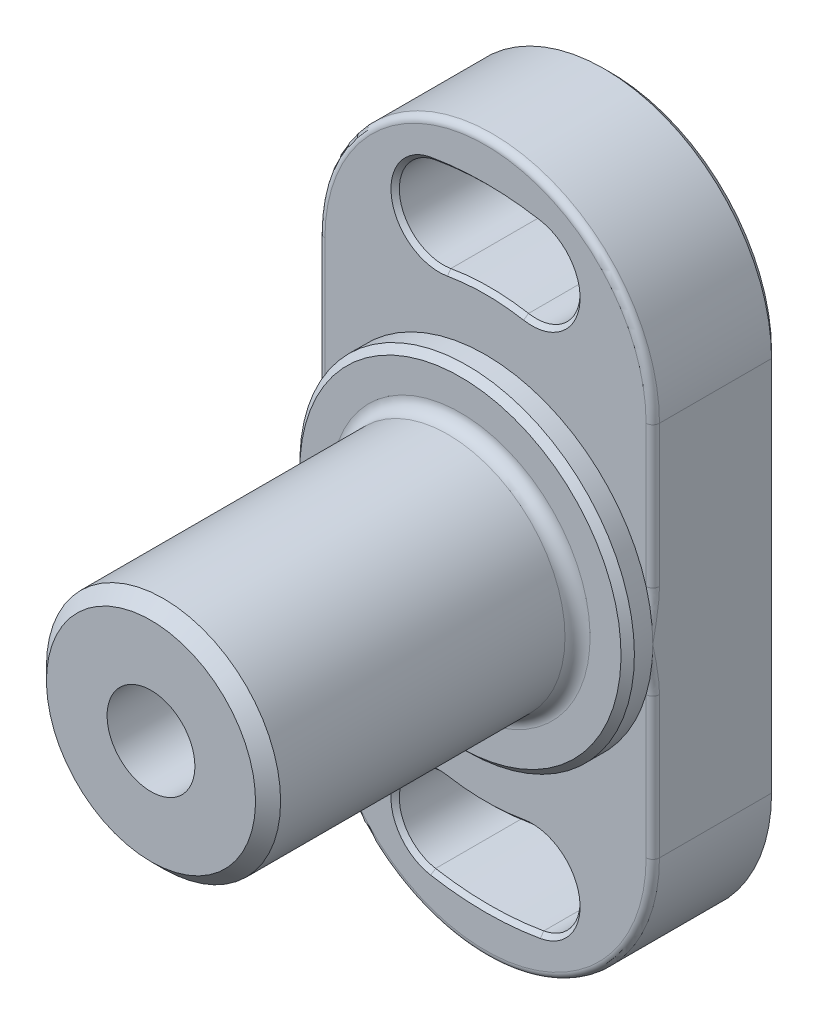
ISO-10303-21;
HEADER;
FILE_DESCRIPTION(('STEP AP214'),'2;1');
FILE_NAME('part.step','',(''),(''),'','','');
FILE_SCHEMA(('AUTOMOTIVE_DESIGN { 1 0 10303 214 1 1 1 1 }'));
ENDSEC;
DATA;
#1=APPLICATION_CONTEXT('core data for automotive mechanical design processes');
#2=APPLICATION_PROTOCOL_DEFINITION('international standard','automotive_design',2000,#1);
#3=PRODUCT_CONTEXT('',#1,'mechanical');
#4=PRODUCT('Part','Part','',(#3));
#5=PRODUCT_RELATED_PRODUCT_CATEGORY('part','',(#4));
#6=PRODUCT_DEFINITION_FORMATION('','',#4);
#7=PRODUCT_DEFINITION_CONTEXT('part definition',#1,'design');
#8=PRODUCT_DEFINITION('design','',#6,#7);
#9=PRODUCT_DEFINITION_SHAPE('','',#8);
#10=(LENGTH_UNIT() NAMED_UNIT(*) SI_UNIT(.MILLI.,.METRE.));
#11=(NAMED_UNIT(*) PLANE_ANGLE_UNIT() SI_UNIT($,.RADIAN.));
#12=(NAMED_UNIT(*) SI_UNIT($,.STERADIAN.) SOLID_ANGLE_UNIT());
#13=UNCERTAINTY_MEASURE_WITH_UNIT(LENGTH_MEASURE(1.E-05),#10,'distance_accuracy_value','');
#14=(GEOMETRIC_REPRESENTATION_CONTEXT(3) GLOBAL_UNCERTAINTY_ASSIGNED_CONTEXT((#13)) GLOBAL_UNIT_ASSIGNED_CONTEXT((#10,
#11,#12)) REPRESENTATION_CONTEXT('',''));
#15=CARTESIAN_POINT('',(0.,0.,0.));
#16=DIRECTION('',(0.,0.,1.));
#17=DIRECTION('',(1.,0.,0.));
#18=AXIS2_PLACEMENT_3D('',#15,#16,#17);
#19=CARTESIAN_POINT('',(14.,0.,55.));
#20=DIRECTION('',(0.,0.,1.));
#21=DIRECTION('',(0.,-1.,0.));
#22=AXIS2_PLACEMENT_3D('',#19,#20,#21);
#23=PLANE('',#22);
#24=CARTESIAN_POINT('',(0.,0.,55.));
#25=DIRECTION('',(0.,0.,1.));
#26=DIRECTION('',(0.,-1.,0.));
#27=AXIS2_PLACEMENT_3D('',#24,#25,#26);
#28=CIRCLE('',#27,12.5);
#29=CARTESIAN_POINT('',(0.,-12.5,55.));
#30=VERTEX_POINT('',#29);
#31=EDGE_CURVE('E9',#30,#30,#28,.T.);
#32=ORIENTED_EDGE('',*,*,#31,.T.);
#33=EDGE_LOOP('',(#32));
#34=FACE_BOUND('',#33,.T.);
#35=CARTESIAN_POINT('',(0.,0.,55.));
#36=DIRECTION('',(0.,0.,-1.));
#37=DIRECTION('',(0.,1.,0.));
#38=AXIS2_PLACEMENT_3D('',#35,#36,#37);
#39=CIRCLE('',#38,5.25);
#40=CARTESIAN_POINT('',(0.,5.25,55.));
#41=VERTEX_POINT('',#40);
#42=EDGE_CURVE('E235',#41,#41,#39,.T.);
#43=ORIENTED_EDGE('',*,*,#42,.T.);
#44=EDGE_LOOP('',(#43));
#45=FACE_BOUND('',#44,.T.);
#46=ADVANCED_FACE('F14',(#34,#45),#23,.T.);
#47=CARTESIAN_POINT('',(0.,0.,0.));
#48=DIRECTION('',(0.,0.,-1.));
#49=DIRECTION('',(0.,1.,0.));
#50=AXIS2_PLACEMENT_3D('',#47,#48,#49);
#51=CYLINDRICAL_SURFACE('',#50,14.);
#52=CARTESIAN_POINT('',(0.,0.,53.5));
#53=DIRECTION('',(0.,0.,1.));
#54=DIRECTION('',(0.,-1.,0.));
#55=AXIS2_PLACEMENT_3D('',#52,#53,#54);
#56=CIRCLE('',#55,14.);
#57=CARTESIAN_POINT('',(0.,-14.,53.5));
#58=VERTEX_POINT('',#57);
#59=EDGE_CURVE('E22',#58,#58,#56,.F.);
#60=ORIENTED_EDGE('',*,*,#59,.T.);
#61=EDGE_LOOP('',(#60));
#62=FACE_BOUND('',#61,.T.);
#63=CARTESIAN_POINT('',(0.,0.,19.5));
#64=DIRECTION('',(0.,0.,1.));
#65=DIRECTION('',(0.,-1.,0.));
#66=AXIS2_PLACEMENT_3D('',#63,#64,#65);
#67=CIRCLE('',#66,14.);
#68=CARTESIAN_POINT('',(0.,-14.,19.5));
#69=VERTEX_POINT('',#68);
#70=EDGE_CURVE('E627',#69,#69,#67,.T.);
#71=ORIENTED_EDGE('',*,*,#70,.T.);
#72=EDGE_LOOP('',(#71));
#73=FACE_BOUND('',#72,.T.);
#74=ADVANCED_FACE('F431',(#62,#73),#51,.T.);
#75=CARTESIAN_POINT('',(0.,0.,15.));
#76=DIRECTION('',(0.,0.,-1.));
#77=DIRECTION('',(0.,1.,0.));
#78=AXIS2_PLACEMENT_3D('',#75,#76,#77);
#79=PLANE('',#78);
#80=CARTESIAN_POINT('',(0.,0.,15.));
#81=DIRECTION('',(0.,0.,-1.));
#82=DIRECTION('',(0.,1.,0.));
#83=AXIS2_PLACEMENT_3D('',#80,#81,#82);
#84=CIRCLE('',#83,5.25);
#85=CARTESIAN_POINT('',(0.,5.25,15.));
#86=VERTEX_POINT('',#85);
#87=EDGE_CURVE('E636',#86,#86,#84,.T.);
#88=ORIENTED_EDGE('',*,*,#87,.F.);
#89=EDGE_LOOP('',(#88));
#90=FACE_BOUND('',#89,.T.);
#91=ADVANCED_FACE('F438',(#90),#79,.F.);
#92=CARTESIAN_POINT('',(0.,0.,0.));
#93=DIRECTION('',(0.,0.,-1.));
#94=DIRECTION('',(0.,1.,0.));
#95=AXIS2_PLACEMENT_3D('',#92,#93,#94);
#96=CYLINDRICAL_SURFACE('',#95,5.25);
#97=ORIENTED_EDGE('',*,*,#42,.F.);
#98=EDGE_LOOP('',(#97));
#99=FACE_BOUND('',#98,.T.);
#100=ORIENTED_EDGE('',*,*,#87,.T.);
#101=EDGE_LOOP('',(#100));
#102=FACE_BOUND('',#101,.T.);
#103=ADVANCED_FACE('F715',(#99,#102),#96,.F.);
#104=CARTESIAN_POINT('',(14.,0.,18.));
#105=DIRECTION('',(0.,0.,1.));
#106=DIRECTION('',(0.,-1.,0.));
#107=AXIS2_PLACEMENT_3D('',#104,#105,#106);
#108=PLANE('',#107);
#109=CARTESIAN_POINT('',(0.,0.,18.));
#110=DIRECTION('',(0.,0.,1.));
#111=DIRECTION('',(0.,-1.,0.));
#112=AXIS2_PLACEMENT_3D('',#109,#110,#111);
#113=CIRCLE('',#112,19.2);
#114=CARTESIAN_POINT('',(0.,-19.2,18.));
#115=VERTEX_POINT('',#114);
#116=EDGE_CURVE('E700',#115,#115,#113,.T.);
#117=ORIENTED_EDGE('',*,*,#116,.T.);
#118=EDGE_LOOP('',(#117));
#119=FACE_BOUND('',#118,.T.);
#120=CARTESIAN_POINT('',(0.,0.,18.));
#121=DIRECTION('',(0.,0.,1.));
#122=DIRECTION('',(0.,-1.,0.));
#123=AXIS2_PLACEMENT_3D('',#120,#121,#122);
#124=CIRCLE('',#123,15.5);
#125=CARTESIAN_POINT('',(0.,-15.5,18.));
#126=VERTEX_POINT('',#125);
#127=EDGE_CURVE('E624',#126,#126,#124,.F.);
#128=ORIENTED_EDGE('',*,*,#127,.T.);
#129=EDGE_LOOP('',(#128));
#130=FACE_BOUND('',#129,.T.);
#131=ADVANCED_FACE('F713',(#119,#130),#108,.T.);
#132=CARTESIAN_POINT('',(0.,0.,0.));
#133=DIRECTION('',(0.,0.,-1.));
#134=DIRECTION('',(0.,1.,0.));
#135=AXIS2_PLACEMENT_3D('',#132,#133,#134);
#136=CYLINDRICAL_SURFACE('',#135,20.);
#137=CARTESIAN_POINT('',(0.,0.,17.2));
#138=DIRECTION('',(0.,0.,1.));
#139=DIRECTION('',(0.,-1.,0.));
#140=AXIS2_PLACEMENT_3D('',#137,#138,#139);
#141=CIRCLE('',#140,20.);
#142=CARTESIAN_POINT('',(0.,-20.,17.2));
#143=VERTEX_POINT('',#142);
#144=EDGE_CURVE('E697',#143,#143,#141,.F.);
#145=ORIENTED_EDGE('',*,*,#144,.T.);
#146=EDGE_LOOP('',(#145));
#147=FACE_BOUND('',#146,.T.);
#148=CARTESIAN_POINT('',(0.,0.,15.));
#149=DIRECTION('',(0.,0.,-1.));
#150=DIRECTION('',(0.,1.,0.));
#151=AXIS2_PLACEMENT_3D('',#148,#149,#150);
#152=CIRCLE('',#151,20.);
#153=CARTESIAN_POINT('',(20.,0.,15.));
#154=VERTEX_POINT('',#153);
#155=CARTESIAN_POINT('',(19.2,-5.6,15.));
#156=VERTEX_POINT('',#155);
#157=EDGE_CURVE('E225',#154,#156,#152,.T.);
#158=ORIENTED_EDGE('',*,*,#157,.F.);
#159=CARTESIAN_POINT('',(19.2,5.6,15.));
#160=VERTEX_POINT('',#159);
#161=EDGE_CURVE('E228',#160,#154,#152,.T.);
#162=ORIENTED_EDGE('',*,*,#161,.F.);
#163=CARTESIAN_POINT('',(-19.2,5.6,15.));
#164=VERTEX_POINT('',#163);
#165=EDGE_CURVE('E242',#164,#160,#152,.T.);
#166=ORIENTED_EDGE('',*,*,#165,.F.);
#167=CARTESIAN_POINT('',(-20.,0.,15.));
#168=VERTEX_POINT('',#167);
#169=EDGE_CURVE('E238',#168,#164,#152,.T.);
#170=ORIENTED_EDGE('',*,*,#169,.F.);
#171=CARTESIAN_POINT('',(-19.2,-5.6,15.));
#172=VERTEX_POINT('',#171);
#173=EDGE_CURVE('E237',#172,#168,#152,.T.);
#174=ORIENTED_EDGE('',*,*,#173,.F.);
#175=EDGE_CURVE('E231',#156,#172,#152,.T.);
#176=ORIENTED_EDGE('',*,*,#175,.F.);
#177=EDGE_LOOP('',(#158,#162,#166,#170,#174,#176));
#178=FACE_BOUND('',#177,.T.);
#179=ADVANCED_FACE('F226',(#147,#178),#136,.T.);
#180=CARTESIAN_POINT('',(0.,22.5,0.));
#181=DIRECTION('',(0.,0.,1.));
#182=DIRECTION('',(0.,-1.,0.));
#183=AXIS2_PLACEMENT_3D('',#180,#181,#182);
#184=PLANE('',#183);
#185=CARTESIAN_POINT('',(5.55674168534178,31.5138480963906,0.));
#186=DIRECTION('',(0.,0.,1.));
#187=DIRECTION('',(0.,-1.,0.));
#188=AXIS2_PLACEMENT_3D('',#185,#186,#187);
#189=CIRCLE('',#188,5.75);
#190=CARTESIAN_POINT('',(4.55826466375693,25.8512035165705,0.));
#191=VERTEX_POINT('',#190);
#192=CARTESIAN_POINT('',(6.55521870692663,37.1764926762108,0.));
#193=VERTEX_POINT('',#192);
#194=EDGE_CURVE('E37',#191,#193,#189,.T.);
#195=ORIENTED_EDGE('',*,*,#194,.T.);
#196=CARTESIAN_POINT('',(0.,0.,0.));
#197=DIRECTION('',(0.,0.,1.));
#198=DIRECTION('',(0.,-1.,0.));
#199=AXIS2_PLACEMENT_3D('',#196,#197,#198);
#200=CIRCLE('',#199,37.75);
#201=CARTESIAN_POINT('',(-6.55521870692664,37.1764926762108,0.));
#202=VERTEX_POINT('',#201);
#203=EDGE_CURVE('E701',#193,#202,#200,.T.);
#204=ORIENTED_EDGE('',*,*,#203,.T.);
#205=CARTESIAN_POINT('',(-5.55674168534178,31.5138480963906,0.));
#206=DIRECTION('',(0.,0.,1.));
#207=DIRECTION('',(0.,-1.,0.));
#208=AXIS2_PLACEMENT_3D('',#205,#206,#207);
#209=CIRCLE('',#208,5.75);
#210=CARTESIAN_POINT('',(-4.55826466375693,25.8512035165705,0.));
#211=VERTEX_POINT('',#210);
#212=EDGE_CURVE('E674',#202,#211,#209,.T.);
#213=ORIENTED_EDGE('',*,*,#212,.T.);
#214=CARTESIAN_POINT('',(0.,0.,0.));
#215=DIRECTION('',(0.,0.,1.));
#216=DIRECTION('',(0.,-1.,0.));
#217=AXIS2_PLACEMENT_3D('',#214,#215,#216);
#218=CIRCLE('',#217,26.25);
#219=EDGE_CURVE('E1124',#211,#191,#218,.F.);
#220=ORIENTED_EDGE('',*,*,#219,.T.);
#221=EDGE_LOOP('',(#195,#204,#213,#220));
#222=FACE_BOUND('',#221,.T.);
#223=CARTESIAN_POINT('',(-5.55674168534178,-31.5138480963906,0.));
#224=DIRECTION('',(0.,0.,1.));
#225=DIRECTION('',(0.,-1.,0.));
#226=AXIS2_PLACEMENT_3D('',#223,#224,#225);
#227=CIRCLE('',#226,5.75);
#228=CARTESIAN_POINT('',(-4.55826466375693,-25.8512035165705,0.));
#229=VERTEX_POINT('',#228);
#230=CARTESIAN_POINT('',(-6.55521870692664,-37.1764926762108,0.));
#231=VERTEX_POINT('',#230);
#232=EDGE_CURVE('E1117',#229,#231,#227,.T.);
#233=ORIENTED_EDGE('',*,*,#232,.T.);
#234=CARTESIAN_POINT('',(0.,0.,0.));
#235=DIRECTION('',(0.,0.,1.));
#236=DIRECTION('',(0.,-1.,0.));
#237=AXIS2_PLACEMENT_3D('',#234,#235,#236);
#238=CIRCLE('',#237,37.75);
#239=CARTESIAN_POINT('',(6.55521870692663,-37.1764926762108,0.));
#240=VERTEX_POINT('',#239);
#241=EDGE_CURVE('E1121',#231,#240,#238,.T.);
#242=ORIENTED_EDGE('',*,*,#241,.T.);
#243=CARTESIAN_POINT('',(5.55674168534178,-31.5138480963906,0.));
#244=DIRECTION('',(0.,0.,1.));
#245=DIRECTION('',(0.,-1.,0.));
#246=AXIS2_PLACEMENT_3D('',#243,#244,#245);
#247=CIRCLE('',#246,5.75);
#248=CARTESIAN_POINT('',(4.55826466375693,-25.8512035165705,0.));
#249=VERTEX_POINT('',#248);
#250=EDGE_CURVE('E1119',#240,#249,#247,.T.);
#251=ORIENTED_EDGE('',*,*,#250,.T.);
#252=CARTESIAN_POINT('',(0.,0.,0.));
#253=DIRECTION('',(0.,0.,1.));
#254=DIRECTION('',(0.,-1.,0.));
#255=AXIS2_PLACEMENT_3D('',#252,#253,#254);
#256=CIRCLE('',#255,26.25);
#257=EDGE_CURVE('E1115',#249,#229,#256,.F.);
#258=ORIENTED_EDGE('',*,*,#257,.T.);
#259=EDGE_LOOP('',(#233,#242,#251,#258));
#260=FACE_BOUND('',#259,.T.);
#261=CARTESIAN_POINT('',(0.,22.5,0.));
#262=DIRECTION('',(0.,0.,1.));
#263=DIRECTION('',(0.,-1.,0.));
#264=AXIS2_PLACEMENT_3D('',#261,#262,#263);
#265=CIRCLE('',#264,19.2);
#266=CARTESIAN_POINT('',(-19.2,22.5,0.));
#267=VERTEX_POINT('',#266);
#268=CARTESIAN_POINT('',(19.2,22.5,0.));
#269=VERTEX_POINT('',#268);
#270=EDGE_CURVE('E1059',#267,#269,#265,.F.);
#271=ORIENTED_EDGE('',*,*,#270,.T.);
#272=DIRECTION('',(0.,-1.,0.));
#273=VECTOR('',#272,1.);
#274=CARTESIAN_POINT('',(19.2,22.5,0.));
#275=LINE('',#274,#273);
#276=CARTESIAN_POINT('',(19.2,-22.5,0.));
#277=VERTEX_POINT('',#276);
#278=EDGE_CURVE('E1176',#269,#277,#275,.T.);
#279=ORIENTED_EDGE('',*,*,#278,.T.);
#280=CARTESIAN_POINT('',(0.,-22.5,0.));
#281=DIRECTION('',(0.,0.,1.));
#282=DIRECTION('',(0.,-1.,0.));
#283=AXIS2_PLACEMENT_3D('',#280,#281,#282);
#284=CIRCLE('',#283,19.2);
#285=CARTESIAN_POINT('',(-19.2,-22.5,0.));
#286=VERTEX_POINT('',#285);
#287=EDGE_CURVE('E1177',#277,#286,#284,.F.);
#288=ORIENTED_EDGE('',*,*,#287,.T.);
#289=DIRECTION('',(0.,1.,0.));
#290=VECTOR('',#289,1.);
#291=CARTESIAN_POINT('',(-19.2,22.5,0.));
#292=LINE('',#291,#290);
#293=EDGE_CURVE('E576',#286,#267,#292,.T.);
#294=ORIENTED_EDGE('',*,*,#293,.T.);
#295=EDGE_LOOP('',(#271,#279,#288,#294));
#296=FACE_BOUND('',#295,.T.);
#297=ADVANCED_FACE('F272',(#222,#260,#296),#184,.F.);
#298=CARTESIAN_POINT('',(0.,0.,15.));
#299=DIRECTION('',(0.,0.,-1.));
#300=DIRECTION('',(0.,1.,0.));
#301=AXIS2_PLACEMENT_3D('',#298,#299,#300);
#302=CYLINDRICAL_SURFACE('',#301,26.75);
#303=DIRECTION('',(0.,0.,-1.));
#304=VECTOR('',#303,1.);
#305=CARTESIAN_POINT('',(-4.64508875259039,26.3436073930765,15.));
#306=LINE('',#305,#304);
#307=CARTESIAN_POINT('',(-4.64508875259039,26.3436073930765,14.5));
#308=VERTEX_POINT('',#307);
#309=CARTESIAN_POINT('',(-4.64508875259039,26.3436073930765,0.5));
#310=VERTEX_POINT('',#309);
#311=EDGE_CURVE('E657',#308,#310,#306,.T.);
#312=ORIENTED_EDGE('',*,*,#311,.F.);
#313=CARTESIAN_POINT('',(0.,0.,14.5));
#314=DIRECTION('',(0.,0.,1.));
#315=DIRECTION('',(0.,-1.,0.));
#316=AXIS2_PLACEMENT_3D('',#313,#314,#315);
#317=CIRCLE('',#316,26.75);
#318=CARTESIAN_POINT('',(4.6450887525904,26.3436073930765,14.5));
#319=VERTEX_POINT('',#318);
#320=EDGE_CURVE('E1086',#308,#319,#317,.F.);
#321=ORIENTED_EDGE('',*,*,#320,.T.);
#322=DIRECTION('',(0.,0.,-1.));
#323=VECTOR('',#322,1.);
#324=CARTESIAN_POINT('',(4.6450887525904,26.3436073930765,15.));
#325=LINE('',#324,#323);
#326=CARTESIAN_POINT('',(4.6450887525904,26.3436073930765,0.5));
#327=VERTEX_POINT('',#326);
#328=EDGE_CURVE('E654',#319,#327,#325,.T.);
#329=ORIENTED_EDGE('',*,*,#328,.T.);
#330=CARTESIAN_POINT('',(0.,0.,0.5));
#331=DIRECTION('',(0.,0.,1.));
#332=DIRECTION('',(0.,-1.,0.));
#333=AXIS2_PLACEMENT_3D('',#330,#331,#332);
#334=CIRCLE('',#333,26.75);
#335=EDGE_CURVE('E1084',#327,#310,#334,.T.);
#336=ORIENTED_EDGE('',*,*,#335,.T.);
#337=EDGE_LOOP('',(#312,#321,#329,#336));
#338=FACE_BOUND('',#337,.T.);
#339=ADVANCED_FACE('F464',(#338),#302,.T.);
#340=CARTESIAN_POINT('',(5.55674168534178,31.5138480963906,15.));
#341=DIRECTION('',(0.,0.,-1.));
#342=DIRECTION('',(0.,1.,0.));
#343=AXIS2_PLACEMENT_3D('',#340,#341,#342);
#344=CYLINDRICAL_SURFACE('',#343,5.25);
#345=ORIENTED_EDGE('',*,*,#328,.F.);
#346=CARTESIAN_POINT('',(5.55674168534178,31.5138480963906,14.5));
#347=DIRECTION('',(0.,0.,1.));
#348=DIRECTION('',(0.,-1.,0.));
#349=AXIS2_PLACEMENT_3D('',#346,#347,#348);
#350=CIRCLE('',#349,5.25);
#351=CARTESIAN_POINT('',(6.46839461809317,36.6840887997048,14.5));
#352=VERTEX_POINT('',#351);
#353=EDGE_CURVE('E1082',#319,#352,#350,.T.);
#354=ORIENTED_EDGE('',*,*,#353,.T.);
#355=DIRECTION('',(0.,0.,-1.));
#356=VECTOR('',#355,1.);
#357=CARTESIAN_POINT('',(6.46839461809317,36.6840887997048,15.));
#358=LINE('',#357,#356);
#359=CARTESIAN_POINT('',(6.46839461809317,36.6840887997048,0.5));
#360=VERTEX_POINT('',#359);
#361=EDGE_CURVE('E651',#352,#360,#358,.T.);
#362=ORIENTED_EDGE('',*,*,#361,.T.);
#363=CARTESIAN_POINT('',(5.55674168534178,31.5138480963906,0.5));
#364=DIRECTION('',(0.,0.,1.));
#365=DIRECTION('',(0.,-1.,0.));
#366=AXIS2_PLACEMENT_3D('',#363,#364,#365);
#367=CIRCLE('',#366,5.25);
#368=EDGE_CURVE('E1080',#360,#327,#367,.F.);
#369=ORIENTED_EDGE('',*,*,#368,.T.);
#370=EDGE_LOOP('',(#345,#354,#362,#369));
#371=FACE_BOUND('',#370,.T.);
#372=ADVANCED_FACE('F460',(#371),#344,.F.);
#373=CARTESIAN_POINT('',(0.,0.,15.));
#374=DIRECTION('',(0.,0.,-1.));
#375=DIRECTION('',(0.,1.,0.));
#376=AXIS2_PLACEMENT_3D('',#373,#374,#375);
#377=CYLINDRICAL_SURFACE('',#376,37.25);
#378=ORIENTED_EDGE('',*,*,#361,.F.);
#379=CARTESIAN_POINT('',(0.,0.,14.5));
#380=DIRECTION('',(0.,0.,1.));
#381=DIRECTION('',(0.,-1.,0.));
#382=AXIS2_PLACEMENT_3D('',#379,#380,#381);
#383=CIRCLE('',#382,37.25);
#384=CARTESIAN_POINT('',(-6.46839461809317,36.6840887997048,14.5));
#385=VERTEX_POINT('',#384);
#386=EDGE_CURVE('E666',#352,#385,#383,.T.);
#387=ORIENTED_EDGE('',*,*,#386,.T.);
#388=DIRECTION('',(0.,0.,-1.));
#389=VECTOR('',#388,1.);
#390=CARTESIAN_POINT('',(-6.46839461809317,36.6840887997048,15.));
#391=LINE('',#390,#389);
#392=CARTESIAN_POINT('',(-6.46839461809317,36.6840887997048,0.5));
#393=VERTEX_POINT('',#392);
#394=EDGE_CURVE('E618',#385,#393,#391,.T.);
#395=ORIENTED_EDGE('',*,*,#394,.T.);
#396=CARTESIAN_POINT('',(0.,0.,0.5));
#397=DIRECTION('',(0.,0.,1.));
#398=DIRECTION('',(0.,-1.,0.));
#399=AXIS2_PLACEMENT_3D('',#396,#397,#398);
#400=CIRCLE('',#399,37.25);
#401=EDGE_CURVE('E664',#393,#360,#400,.F.);
#402=ORIENTED_EDGE('',*,*,#401,.T.);
#403=EDGE_LOOP('',(#378,#387,#395,#402));
#404=FACE_BOUND('',#403,.T.);
#405=ADVANCED_FACE('F463',(#404),#377,.F.);
#406=CARTESIAN_POINT('',(-5.55674168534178,31.5138480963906,15.));
#407=DIRECTION('',(0.,0.,-1.));
#408=DIRECTION('',(0.,1.,0.));
#409=AXIS2_PLACEMENT_3D('',#406,#407,#408);
#410=CYLINDRICAL_SURFACE('',#409,5.25);
#411=ORIENTED_EDGE('',*,*,#394,.F.);
#412=CARTESIAN_POINT('',(-5.55674168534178,31.5138480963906,14.5));
#413=DIRECTION('',(0.,0.,1.));
#414=DIRECTION('',(0.,-1.,0.));
#415=AXIS2_PLACEMENT_3D('',#412,#413,#414);
#416=CIRCLE('',#415,5.25);
#417=EDGE_CURVE('E1078',#385,#308,#416,.T.);
#418=ORIENTED_EDGE('',*,*,#417,.T.);
#419=ORIENTED_EDGE('',*,*,#311,.T.);
#420=CARTESIAN_POINT('',(-5.55674168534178,31.5138480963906,0.5));
#421=DIRECTION('',(0.,0.,1.));
#422=DIRECTION('',(0.,-1.,0.));
#423=AXIS2_PLACEMENT_3D('',#420,#421,#422);
#424=CIRCLE('',#423,5.25);
#425=EDGE_CURVE('E673',#310,#393,#424,.F.);
#426=ORIENTED_EDGE('',*,*,#425,.T.);
#427=EDGE_LOOP('',(#411,#418,#419,#426));
#428=FACE_BOUND('',#427,.T.);
#429=ADVANCED_FACE('F469',(#428),#410,.F.);
#430=CARTESIAN_POINT('',(0.,22.5,15.));
#431=DIRECTION('',(0.,0.,-1.));
#432=DIRECTION('',(0.,1.,0.));
#433=AXIS2_PLACEMENT_3D('',#430,#431,#432);
#434=CYLINDRICAL_SURFACE('',#433,20.);
#435=DIRECTION('',(0.,0.,-1.));
#436=VECTOR('',#435,1.);
#437=CARTESIAN_POINT('',(20.,22.5,15.));
#438=LINE('',#437,#436);
#439=CARTESIAN_POINT('',(20.,22.5,14.2));
#440=VERTEX_POINT('',#439);
#441=CARTESIAN_POINT('',(20.,22.5,0.799999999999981));
#442=VERTEX_POINT('',#441);
#443=EDGE_CURVE('E614',#440,#442,#438,.T.);
#444=ORIENTED_EDGE('',*,*,#443,.T.);
#445=CARTESIAN_POINT('',(0.,22.5,0.799999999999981));
#446=DIRECTION('',(0.,0.,1.));
#447=DIRECTION('',(0.,-1.,0.));
#448=AXIS2_PLACEMENT_3D('',#445,#446,#447);
#449=CIRCLE('',#448,20.);
#450=CARTESIAN_POINT('',(-20.,22.5,0.799999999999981));
#451=VERTEX_POINT('',#450);
#452=EDGE_CURVE('E1058',#442,#451,#449,.T.);
#453=ORIENTED_EDGE('',*,*,#452,.T.);
#454=DIRECTION('',(0.,0.,-1.));
#455=VECTOR('',#454,1.);
#456=CARTESIAN_POINT('',(-20.,22.5,15.));
#457=LINE('',#456,#455);
#458=CARTESIAN_POINT('',(-20.,22.5,14.2));
#459=VERTEX_POINT('',#458);
#460=EDGE_CURVE('E616',#459,#451,#457,.T.);
#461=ORIENTED_EDGE('',*,*,#460,.F.);
#462=CARTESIAN_POINT('',(0.,22.5,14.2));
#463=DIRECTION('',(0.,0.,1.));
#464=DIRECTION('',(0.,-1.,0.));
#465=AXIS2_PLACEMENT_3D('',#462,#463,#464);
#466=CIRCLE('',#465,20.);
#467=EDGE_CURVE('E530',#459,#440,#466,.F.);
#468=ORIENTED_EDGE('',*,*,#467,.T.);
#469=EDGE_LOOP('',(#444,#453,#461,#468));
#470=FACE_BOUND('',#469,.T.);
#471=ADVANCED_FACE('F452',(#470),#434,.T.);
#472=CARTESIAN_POINT('',(-5.55674168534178,-31.5138480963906,15.));
#473=DIRECTION('',(0.,0.,-1.));
#474=DIRECTION('',(0.,1.,0.));
#475=AXIS2_PLACEMENT_3D('',#472,#473,#474);
#476=CYLINDRICAL_SURFACE('',#475,5.25);
#477=DIRECTION('',(0.,0.,-1.));
#478=VECTOR('',#477,1.);
#479=CARTESIAN_POINT('',(-4.64508875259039,-26.3436073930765,15.));
#480=LINE('',#479,#478);
#481=CARTESIAN_POINT('',(-4.64508875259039,-26.3436073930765,14.5));
#482=VERTEX_POINT('',#481);
#483=CARTESIAN_POINT('',(-4.64508875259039,-26.3436073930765,0.5));
#484=VERTEX_POINT('',#483);
#485=EDGE_CURVE('E645',#482,#484,#480,.T.);
#486=ORIENTED_EDGE('',*,*,#485,.F.);
#487=CARTESIAN_POINT('',(-5.55674168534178,-31.5138480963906,14.5));
#488=DIRECTION('',(0.,0.,1.));
#489=DIRECTION('',(0.,-1.,0.));
#490=AXIS2_PLACEMENT_3D('',#487,#488,#489);
#491=CIRCLE('',#490,5.25);
#492=CARTESIAN_POINT('',(-6.46839461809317,-36.6840887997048,14.5));
#493=VERTEX_POINT('',#492);
#494=EDGE_CURVE('E1109',#482,#493,#491,.T.);
#495=ORIENTED_EDGE('',*,*,#494,.T.);
#496=DIRECTION('',(0.,0.,-1.));
#497=VECTOR('',#496,1.);
#498=CARTESIAN_POINT('',(-6.46839461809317,-36.6840887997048,15.));
#499=LINE('',#498,#497);
#500=CARTESIAN_POINT('',(-6.46839461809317,-36.6840887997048,0.5));
#501=VERTEX_POINT('',#500);
#502=EDGE_CURVE('E642',#493,#501,#499,.T.);
#503=ORIENTED_EDGE('',*,*,#502,.T.);
#504=CARTESIAN_POINT('',(-5.55674168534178,-31.5138480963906,0.5));
#505=DIRECTION('',(0.,0.,1.));
#506=DIRECTION('',(0.,-1.,0.));
#507=AXIS2_PLACEMENT_3D('',#504,#505,#506);
#508=CIRCLE('',#507,5.25);
#509=EDGE_CURVE('E1107',#501,#484,#508,.F.);
#510=ORIENTED_EDGE('',*,*,#509,.T.);
#511=EDGE_LOOP('',(#486,#495,#503,#510));
#512=FACE_BOUND('',#511,.T.);
#513=ADVANCED_FACE('F448',(#512),#476,.F.);
#514=CARTESIAN_POINT('',(0.,0.,15.));
#515=DIRECTION('',(0.,0.,-1.));
#516=DIRECTION('',(0.,1.,0.));
#517=AXIS2_PLACEMENT_3D('',#514,#515,#516);
#518=CYLINDRICAL_SURFACE('',#517,37.25);
#519=ORIENTED_EDGE('',*,*,#502,.F.);
#520=CARTESIAN_POINT('',(0.,0.,14.5));
#521=DIRECTION('',(0.,0.,1.));
#522=DIRECTION('',(0.,-1.,0.));
#523=AXIS2_PLACEMENT_3D('',#520,#521,#522);
#524=CIRCLE('',#523,37.25);
#525=CARTESIAN_POINT('',(6.46839461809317,-36.6840887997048,14.5));
#526=VERTEX_POINT('',#525);
#527=EDGE_CURVE('E1091',#493,#526,#524,.T.);
#528=ORIENTED_EDGE('',*,*,#527,.T.);
#529=DIRECTION('',(0.,0.,-1.));
#530=VECTOR('',#529,1.);
#531=CARTESIAN_POINT('',(6.46839461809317,-36.6840887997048,15.));
#532=LINE('',#531,#530);
#533=CARTESIAN_POINT('',(6.46839461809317,-36.6840887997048,0.5));
#534=VERTEX_POINT('',#533);
#535=EDGE_CURVE('E639',#526,#534,#532,.T.);
#536=ORIENTED_EDGE('',*,*,#535,.T.);
#537=CARTESIAN_POINT('',(0.,0.,0.5));
#538=DIRECTION('',(0.,0.,1.));
#539=DIRECTION('',(0.,-1.,0.));
#540=AXIS2_PLACEMENT_3D('',#537,#538,#539);
#541=CIRCLE('',#540,37.25);
#542=EDGE_CURVE('E1088',#534,#501,#541,.F.);
#543=ORIENTED_EDGE('',*,*,#542,.T.);
#544=EDGE_LOOP('',(#519,#528,#536,#543));
#545=FACE_BOUND('',#544,.T.);
#546=ADVANCED_FACE('F444',(#545),#518,.F.);
#547=CARTESIAN_POINT('',(5.55674168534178,-31.5138480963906,15.));
#548=DIRECTION('',(0.,0.,-1.));
#549=DIRECTION('',(0.,1.,0.));
#550=AXIS2_PLACEMENT_3D('',#547,#548,#549);
#551=CYLINDRICAL_SURFACE('',#550,5.25);
#552=ORIENTED_EDGE('',*,*,#535,.F.);
#553=CARTESIAN_POINT('',(5.55674168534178,-31.5138480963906,14.5));
#554=DIRECTION('',(0.,0.,1.));
#555=DIRECTION('',(0.,-1.,0.));
#556=AXIS2_PLACEMENT_3D('',#553,#554,#555);
#557=CIRCLE('',#556,5.25);
#558=CARTESIAN_POINT('',(4.6450887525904,-26.3436073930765,14.5));
#559=VERTEX_POINT('',#558);
#560=EDGE_CURVE('E1105',#526,#559,#557,.T.);
#561=ORIENTED_EDGE('',*,*,#560,.T.);
#562=DIRECTION('',(0.,0.,-1.));
#563=VECTOR('',#562,1.);
#564=CARTESIAN_POINT('',(4.6450887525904,-26.3436073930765,15.));
#565=LINE('',#564,#563);
#566=CARTESIAN_POINT('',(4.6450887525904,-26.3436073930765,0.5));
#567=VERTEX_POINT('',#566);
#568=EDGE_CURVE('E648',#559,#567,#565,.T.);
#569=ORIENTED_EDGE('',*,*,#568,.T.);
#570=CARTESIAN_POINT('',(5.55674168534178,-31.5138480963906,0.5));
#571=DIRECTION('',(0.,0.,1.));
#572=DIRECTION('',(0.,-1.,0.));
#573=AXIS2_PLACEMENT_3D('',#570,#571,#572);
#574=CIRCLE('',#573,5.25);
#575=EDGE_CURVE('E1103',#567,#534,#574,.F.);
#576=ORIENTED_EDGE('',*,*,#575,.T.);
#577=EDGE_LOOP('',(#552,#561,#569,#576));
#578=FACE_BOUND('',#577,.T.);
#579=ADVANCED_FACE('F447',(#578),#551,.F.);
#580=CARTESIAN_POINT('',(0.,0.,15.));
#581=DIRECTION('',(0.,0.,-1.));
#582=DIRECTION('',(0.,1.,0.));
#583=AXIS2_PLACEMENT_3D('',#580,#581,#582);
#584=CYLINDRICAL_SURFACE('',#583,26.75);
#585=ORIENTED_EDGE('',*,*,#568,.F.);
#586=CARTESIAN_POINT('',(0.,0.,14.5));
#587=DIRECTION('',(0.,0.,1.));
#588=DIRECTION('',(0.,-1.,0.));
#589=AXIS2_PLACEMENT_3D('',#586,#587,#588);
#590=CIRCLE('',#589,26.75);
#591=EDGE_CURVE('E1113',#559,#482,#590,.F.);
#592=ORIENTED_EDGE('',*,*,#591,.T.);
#593=ORIENTED_EDGE('',*,*,#485,.T.);
#594=CARTESIAN_POINT('',(0.,0.,0.5));
#595=DIRECTION('',(0.,0.,1.));
#596=DIRECTION('',(0.,-1.,0.));
#597=AXIS2_PLACEMENT_3D('',#594,#595,#596);
#598=CIRCLE('',#597,26.75);
#599=EDGE_CURVE('E1111',#484,#567,#598,.T.);
#600=ORIENTED_EDGE('',*,*,#599,.T.);
#601=EDGE_LOOP('',(#585,#592,#593,#600));
#602=FACE_BOUND('',#601,.T.);
#603=ADVANCED_FACE('F271',(#602),#584,.T.);
#604=CARTESIAN_POINT('',(20.,22.5,15.));
#605=DIRECTION('',(-1.,0.,0.));
#606=DIRECTION('',(0.,-1.,0.));
#607=AXIS2_PLACEMENT_3D('',#604,#605,#606);
#608=PLANE('',#607);
#609=DIRECTION('',(0.,0.,-1.));
#610=VECTOR('',#609,1.);
#611=CARTESIAN_POINT('',(20.,-22.5,15.));
#612=LINE('',#611,#610);
#613=CARTESIAN_POINT('',(20.,-22.5,14.2));
#614=VERTEX_POINT('',#613);
#615=CARTESIAN_POINT('',(20.,-22.5,0.799999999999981));
#616=VERTEX_POINT('',#615);
#617=EDGE_CURVE('E607',#614,#616,#612,.T.);
#618=ORIENTED_EDGE('',*,*,#617,.T.);
#619=DIRECTION('',(0.,1.,0.));
#620=VECTOR('',#619,1.);
#621=CARTESIAN_POINT('',(20.,22.5,0.799999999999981));
#622=LINE('',#621,#620);
#623=EDGE_CURVE('E336',#616,#442,#622,.T.);
#624=ORIENTED_EDGE('',*,*,#623,.T.);
#625=ORIENTED_EDGE('',*,*,#443,.F.);
#626=DIRECTION('',(0.,1.,0.));
#627=VECTOR('',#626,1.);
#628=CARTESIAN_POINT('',(20.,0.,14.2));
#629=LINE('',#628,#627);
#630=CARTESIAN_POINT('',(20.,5.6,14.2));
#631=VERTEX_POINT('',#630);
#632=EDGE_CURVE('E216',#440,#631,#629,.F.);
#633=ORIENTED_EDGE('',*,*,#632,.T.);
#634=CARTESIAN_POINT('',(18.6952698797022,7.10541231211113,15.));
#635=CARTESIAN_POINT('',(19.0873367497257,7.00687599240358,15.3032137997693));
#636=CARTESIAN_POINT('',(19.5436683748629,7.07396891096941,15.096756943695));
#637=CARTESIAN_POINT('',(20.,7.14106182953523,14.8903000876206));
#638=CARTESIAN_POINT('',(20.,7.29724243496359,14.4097045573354));
#639=CARTESIAN_POINT('',(18.7053348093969,7.07893052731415,15.));
#640=CARTESIAN_POINT('',(19.0990203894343,6.98697142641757,15.2956547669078));
#641=CARTESIAN_POINT('',(19.5495248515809,7.05204468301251,15.0867001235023));
#642=CARTESIAN_POINT('',(20.,7.11723203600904,14.8777966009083));
#643=CARTESIAN_POINT('',(20.,7.26611696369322,14.3995941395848));
#644=CARTESIAN_POINT('',(18.7154165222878,7.05223440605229,15.));
#645=CARTESIAN_POINT('',(19.1104595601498,6.96619998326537,15.2880608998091));
#646=CARTESIAN_POINT('',(19.5552432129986,7.02935708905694,15.0768369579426));
#647=CARTESIAN_POINT('',(20.,7.09262732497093,14.8656595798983));
#648=CARTESIAN_POINT('',(20.,7.23481535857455,14.3900440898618));
#649=CARTESIAN_POINT('',(18.7355878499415,6.99846918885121,15.));
#650=CARTESIAN_POINT('',(19.1328209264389,6.92327660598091,15.2729430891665));
#651=CARTESIAN_POINT('',(19.5664239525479,6.98270040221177,15.0575407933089));
#652=CARTESIAN_POINT('',(20.,7.04223576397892,14.84218486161));
#653=CARTESIAN_POINT('',(20.,7.1719282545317,14.3719563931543));
#654=CARTESIAN_POINT('',(18.7456774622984,6.97140018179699,15.));
#655=CARTESIAN_POINT('',(19.1437485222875,6.90112622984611,15.265416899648));
#656=CARTESIAN_POINT('',(19.5718863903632,6.95873161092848,15.0481076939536));
#657=CARTESIAN_POINT('',(20.,7.01644853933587,14.8308402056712));
#658=CARTESIAN_POINT('',(20.,7.1403428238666,14.3634185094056));
#659=CARTESIAN_POINT('',(18.7759059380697,6.88975480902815,15.));
#660=CARTESIAN_POINT('',(19.175729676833,6.83316422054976,15.2431464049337));
#661=CARTESIAN_POINT('',(19.587913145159,6.8853056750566,15.0205298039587));
#662=CARTESIAN_POINT('',(20.,6.93788895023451,14.7980794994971));
#663=CARTESIAN_POINT('',(20.,7.04530675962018,14.3391707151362));
#664=CARTESIAN_POINT('',(18.7960253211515,6.83468520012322,15.));
#665=CARTESIAN_POINT('',(19.1961775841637,6.78549107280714,15.2285788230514));
#666=CARTESIAN_POINT('',(19.5981289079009,6.83428270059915,15.0030854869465));
#667=CARTESIAN_POINT('',(20.,6.88350212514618,14.7777266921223));
#668=CARTESIAN_POINT('',(20.,6.98151182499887,14.3248062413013));
#669=CARTESIAN_POINT('',(18.8360143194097,6.72369200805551,15.));
#670=CARTESIAN_POINT('',(19.2353884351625,6.68704171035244,15.2004717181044));
#671=CARTESIAN_POINT('',(19.6177336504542,6.72947405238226,14.9701592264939));
#672=CARTESIAN_POINT('',(20.,6.77232913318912,14.7399793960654));
#673=CARTESIAN_POINT('',(20.,6.85355238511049,14.299082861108));
#674=CARTESIAN_POINT('',(18.8558845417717,6.66777186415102,15.));
#675=CARTESIAN_POINT('',(19.2541837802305,6.63626709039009,15.1869110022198));
#676=CARTESIAN_POINT('',(19.6271252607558,6.67569810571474,14.9546709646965));
#677=CARTESIAN_POINT('',(20.,6.71553227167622,14.7225386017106));
#678=CARTESIAN_POINT('',(20.,6.78938980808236,14.287714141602));
#679=CARTESIAN_POINT('',(18.8953685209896,6.5550452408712,15.));
#680=CARTESIAN_POINT('',(19.2903927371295,6.53225072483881,15.1608598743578));
#681=CARTESIAN_POINT('',(19.6452292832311,6.56596593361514,14.9254935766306));
#682=CARTESIAN_POINT('',(20.,6.60008151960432,14.690233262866));
#683=CARTESIAN_POINT('',(20.,6.66065848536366,14.267469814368));
#684=CARTESIAN_POINT('',(18.9149821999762,6.49823850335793,15.));
#685=CARTESIAN_POINT('',(19.3078274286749,6.47899333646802,15.1483537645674));
#686=CARTESIAN_POINT('',(19.6539414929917,6.51000906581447,14.911804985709));
#687=CARTESIAN_POINT('',(20.,6.54140411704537,14.6753405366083));
#688=CARTESIAN_POINT('',(20.,6.5960896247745,14.2585949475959));
#689=CARTESIAN_POINT('',(18.972931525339,6.3278862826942,15.));
#690=CARTESIAN_POINT('',(19.3578023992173,6.3180542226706,15.1128469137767));
#691=CARTESIAN_POINT('',(19.6790110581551,6.34088790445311,14.873528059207));
#692=CARTESIAN_POINT('',(20.,6.3651949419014,14.6345456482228));
#693=CARTESIAN_POINT('',(20.,6.40335908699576,14.2353472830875));
#694=CARTESIAN_POINT('',(19.0107995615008,6.21323355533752,15.));
#695=CARTESIAN_POINT('',(19.3888429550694,6.20699479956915,15.091249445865));
#696=CARTESIAN_POINT('',(19.6945038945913,6.22534321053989,14.8513868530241));
#697=CARTESIAN_POINT('',(20.,6.24500725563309,14.6117445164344));
#698=CARTESIAN_POINT('',(20.,6.27481866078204,14.224096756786));
#699=CARTESIAN_POINT('',(19.0849958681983,5.98145260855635,15.));
#700=CARTESIAN_POINT('',(19.447139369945,5.98006431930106,15.0521003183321));
#701=CARTESIAN_POINT('',(19.7236495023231,5.99020744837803,14.8126917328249));
#702=CARTESIAN_POINT('',(20.,6.00165249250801,14.5734936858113));
#703=CARTESIAN_POINT('',(20.,6.01724515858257,14.2081095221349));
#704=CARTESIAN_POINT('',(19.1213225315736,5.8643219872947,15.));
#705=CARTESIAN_POINT('',(19.4744799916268,5.86405907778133,15.034476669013));
#706=CARTESIAN_POINT('',(19.7373003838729,5.870612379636,14.7961435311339));
#707=CARTESIAN_POINT('',(20.,5.87831967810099,14.557939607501));
#708=CARTESIAN_POINT('',(20.,5.88821171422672,14.203379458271));
#709=CARTESIAN_POINT('',(19.2226966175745,5.5263499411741,15.));
#710=CARTESIAN_POINT('',(19.5478927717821,5.52895059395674,14.9894500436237));
#711=CARTESIAN_POINT('',(19.774159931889,5.52477378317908,14.7555982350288));
#712=CARTESIAN_POINT('',(20.,5.52456603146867,14.5222229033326));
#713=CARTESIAN_POINT('',(20.,5.51900240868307,14.1973585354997));
#714=CARTESIAN_POINT('',(19.2855626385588,5.30298772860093,15.));
#715=CARTESIAN_POINT('',(19.5907022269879,5.3038844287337,14.9660745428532));
#716=CARTESIAN_POINT('',(19.7954863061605,5.29530633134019,14.7374428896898));
#717=CARTESIAN_POINT('',(20.,5.28992058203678,14.5089876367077));
#718=CARTESIAN_POINT('',(20.,5.27872332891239,14.202528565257));
#719=CARTESIAN_POINT('',(19.4042990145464,4.85056363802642,15.));
#720=CARTESIAN_POINT('',(19.6679488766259,4.84770947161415,14.9294233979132));
#721=CARTESIAN_POINT('',(19.834102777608,4.83166809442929,14.7134478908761));
#722=CARTESIAN_POINT('',(20.,4.81876172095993,14.4976235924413));
#723=CARTESIAN_POINT('',(20.,4.79875836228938,14.225786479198));
#724=CARTESIAN_POINT('',(19.460165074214,4.62149836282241,15.));
#725=CARTESIAN_POINT('',(19.7026139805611,4.61596931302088,14.915960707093));
#726=CARTESIAN_POINT('',(19.8513904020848,4.59749452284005,14.7076157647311));
#727=CARTESIAN_POINT('',(20.,4.58153988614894,14.4992826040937));
#728=CARTESIAN_POINT('',(20.,4.55907292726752,14.2438822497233));
#729=CARTESIAN_POINT('',(19.5643476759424,4.15844495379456,15.));
#730=CARTESIAN_POINT('',(19.7650940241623,4.14852753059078,14.8969647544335));
#731=CARTESIAN_POINT('',(19.8826299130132,4.12620289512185,14.7053830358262));
#732=CARTESIAN_POINT('',(20.,4.10637625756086,14.5138133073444));
#733=CARTESIAN_POINT('',(20.,4.08036417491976,14.2897474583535));
#734=CARTESIAN_POINT('',(19.6126550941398,3.92445125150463,15.));
#735=CARTESIAN_POINT('',(19.7930498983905,3.91228869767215,14.8913338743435));
#736=CARTESIAN_POINT('',(19.8965777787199,3.88908164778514,14.7089937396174));
#737=CARTESIAN_POINT('',(20.,3.8678574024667,14.526597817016));
#738=CARTESIAN_POINT('',(20.,3.8413419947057,14.3175284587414));
#739=CARTESIAN_POINT('',(19.701196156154,3.45261455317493,15.));
#740=CARTESIAN_POINT('',(19.842995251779,3.43745078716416,14.8862749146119));
#741=CARTESIAN_POINT('',(19.9215480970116,3.41324026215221,14.7234521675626));
#742=CARTESIAN_POINT('',(20.,3.39098373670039,14.5605656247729));
#743=CARTESIAN_POINT('',(20.,3.36424376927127,14.3803692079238));
#744=CARTESIAN_POINT('',(19.7414285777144,3.21477098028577,15.));
#745=CARTESIAN_POINT('',(19.8650834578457,3.19838934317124,14.8867917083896));
#746=CARTESIAN_POINT('',(19.9325701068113,3.17451988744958,14.734300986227));
#747=CARTESIAN_POINT('',(20.,3.15214414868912,14.5817156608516));
#748=CARTESIAN_POINT('',(20.,3.12616787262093,14.4154300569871));
#749=CARTESIAN_POINT('',(19.8500997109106,2.49235468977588,15.));
#750=CARTESIAN_POINT('',(19.9234720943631,2.47709629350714,14.8954289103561));
#751=CARTESIAN_POINT('',(19.9618641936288,2.4526858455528,14.7751866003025));
#752=CARTESIAN_POINT('',(20.,2.43440040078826,14.6546173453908));
#753=CARTESIAN_POINT('',(20.,2.40897616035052,14.5293358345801));
#754=CARTESIAN_POINT('',(19.905561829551,2.00308043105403,15.));
#755=CARTESIAN_POINT('',(19.9521271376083,1.98787328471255,14.9106730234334));
#756=CARTESIAN_POINT('',(19.9760953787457,1.96815693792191,14.8135140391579));
#757=CARTESIAN_POINT('',(20.,1.95140371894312,14.7161149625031));
#758=CARTESIAN_POINT('',(20.,1.93119082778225,14.6164202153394));
#759=CARTESIAN_POINT('',(19.9801390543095,1.01865168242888,15.));
#760=CARTESIAN_POINT('',(19.990090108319,1.0099336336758,14.9501063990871));
#761=CARTESIAN_POINT('',(19.9950700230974,0.998329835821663,14.9002788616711));
#762=CARTESIAN_POINT('',(20.,0.98956512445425,14.8501724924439));
#763=CARTESIAN_POINT('',(20.,0.977984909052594,14.8004640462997));
#764=CARTESIAN_POINT('',(19.9992793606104,0.523501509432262,15.));
#765=CARTESIAN_POINT('',(19.9996398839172,0.51829394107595,14.9743539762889));
#766=CARTESIAN_POINT('',(19.9998200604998,0.513032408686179,14.9487092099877));
#767=CARTESIAN_POINT('',(19.9999999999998,0.507823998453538,14.9230591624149));
#768=CARTESIAN_POINT('',(20.,0.502562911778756,14.8974166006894));
#769=CARTESIAN_POINT('',(19.9999866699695,0.0235698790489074,15.));
#770=CARTESIAN_POINT('',(19.9999933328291,0.0233341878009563,14.9988453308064));
#771=CARTESIAN_POINT('',(19.999996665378,0.0230984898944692,14.9976906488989));
#772=CARTESIAN_POINT('',(20.,0.0228627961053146,14.9965359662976));
#773=CARTESIAN_POINT('',(20.,0.0226270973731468,14.9953812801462));
#774=CARTESIAN_POINT('',(19.9999916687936,0.0188555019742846,15.));
#775=CARTESIAN_POINT('',(19.99999583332,0.0186669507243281,14.999076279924));
#776=CARTESIAN_POINT('',(19.9999979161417,0.0184783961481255,14.9981525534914));
#777=CARTESIAN_POINT('',(20.,0.0182898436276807,14.9972288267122));
#778=CARTESIAN_POINT('',(20.,0.0181012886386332,14.9963050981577));
#779=CARTESIAN_POINT('',(19.999998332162,0.00942741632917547,15.));
#780=CARTESIAN_POINT('',(19.9999991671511,0.00933314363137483,14.9995381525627));
#781=CARTESIAN_POINT('',(19.9999995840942,0.00923886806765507,14.9990763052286));
#782=CARTESIAN_POINT('',(20.,0.00914459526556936,14.9986144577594));
#783=CARTESIAN_POINT('',(20.,0.00905031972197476,14.9981526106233));
#784=CARTESIAN_POINT('',(19.9999999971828,0.00471370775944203,15.));
#785=CARTESIAN_POINT('',(20.0000000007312,0.00466657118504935,14.9997690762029));
#786=CARTESIAN_POINT('',(20.0000000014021,0.0046194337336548,14.999538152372));
#787=CARTESIAN_POINT('',(20.,0.00457229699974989,14.9993072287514));
#788=CARTESIAN_POINT('',(20.,0.00452515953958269,14.9990763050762));
#789=CARTESIAN_POINT('',(20.,0.,15.));
#790=CARTESIAN_POINT('',(20.,0.,15.));
#791=CARTESIAN_POINT('',(20.,0.,15.));
#792=CARTESIAN_POINT('',(20.,0.,15.));
#793=CARTESIAN_POINT('',(20.,0.,15.));
#794=(BOUNDED_SURFACE() B_SPLINE_SURFACE(3,2,((#634,#635,#636,#637,#638),(#639,#640,#641,#642,
#643),(#644,#645,#646,#647,#648),(#649,#650,#651,#652,#653),(#654,#655,#656,#657,#658),(#659,
#660,#661,#662,#663),(#664,#665,#666,#667,#668),(#669,#670,#671,#672,#673),(#674,#675,#676,#677,
#678),(#679,#680,#681,#682,#683),(#684,#685,#686,#687,#688),(#689,#690,#691,#692,#693),(#694,
#695,#696,#697,#698),(#699,#700,#701,#702,#703),(#704,#705,#706,#707,#708),(#709,#710,#711,#712,
#713),(#714,#715,#716,#717,#718),(#719,#720,#721,#722,#723),(#724,#725,#726,#727,#728),(#729,
#730,#731,#732,#733),(#734,#735,#736,#737,#738),(#739,#740,#741,#742,#743),(#744,#745,#746,#747,
#748),(#749,#750,#751,#752,#753),(#754,#755,#756,#757,#758),(#759,#760,#761,#762,#763),(#764,
#765,#766,#767,#768),(#769,#770,#771,#772,#773),(#774,#775,#776,#777,#778),(#779,#780,#781,#782,
#783),(#784,#785,#786,#787,#788),(#789,#790,#791,#792,#793)),.UNSPECIFIED.,.F.,.F.,
.F.) B_SPLINE_SURFACE_WITH_KNOTS((4,2,2,2,2,2,2,2,2,2,2,2,2,2,2,4),(3,2,3),(0.,
0.0981650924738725,0.196307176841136,0.392388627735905,0.587819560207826,0.783308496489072,
1.17015986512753,1.55740515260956,2.27784252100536,2.9987198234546,3.7204606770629,
4.44231069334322,5.89896064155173,7.35459959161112,7.36845698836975,7.38231240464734),(0.,0.5,
1.),.UNSPECIFIED.) GEOMETRIC_REPRESENTATION_ITEM() RATIONAL_B_SPLINE_SURFACE(((1.,
0.845454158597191,1.,0.845454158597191,1.),(1.,0.847618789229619,1.,0.847618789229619,1.),(1.,
0.849724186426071,1.,0.849724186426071,1.),(1.,0.853826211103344,1.,0.853826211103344,1.),(1.,
0.855822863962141,1.,0.855822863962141,1.),(1.,0.861661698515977,1.,0.861661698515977,1.),(1.,
0.865357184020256,1.,0.865357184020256,1.),(1.,0.872408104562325,1.,0.872408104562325,1.),(1.,
0.875764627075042,1.,0.875764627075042,1.),(1.,0.882201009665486,1.,0.882201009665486,1.),(1.,
0.885280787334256,1.,0.885280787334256,1.),(1.,0.894100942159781,1.,0.894100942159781,1.),(1.,
0.899494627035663,1.,0.899494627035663,1.),(1.,0.909563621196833,1.,0.909563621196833,1.),(1.,
0.914238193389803,1.,0.914238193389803,1.),(1.,0.926777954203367,1.,0.926777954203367,1.),(1.,
0.933927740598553,1.,0.933927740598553,1.),(1.,0.946759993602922,1.,0.946759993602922,1.),(1.,
0.952441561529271,1.,0.952441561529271,1.),(1.,0.962636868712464,1.,0.962636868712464,1.),(1.,
0.96714920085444,1.,0.96714920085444,1.),(1.,0.97518376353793,1.,0.97518376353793,1.),(1.,
0.978705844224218,1.,0.978705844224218,1.),(1.,0.988031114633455,1.,0.988031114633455,1.),(1.,
0.99250675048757,1.,0.99250675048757,1.),(1.,0.998462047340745,1.,0.998462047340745,1.),(1.,
0.999943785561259,1.,0.999943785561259,1.),(1.,0.999998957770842,1.,0.999998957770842,1.),(1.,
0.999999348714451,1.,0.999999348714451,1.),(1.,0.999999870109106,1.,0.999999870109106,1.),(1.,
1.00000000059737,1.,1.00000000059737,1.),(1.,1.,1.,1.,1.))) REPRESENTATION_ITEM('') SURFACE());
#795=CARTESIAN_POINT('',(20.,7.29724243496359,14.4097045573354));
#796=CARTESIAN_POINT('',(20.,7.26611696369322,14.3995941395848));
#797=CARTESIAN_POINT('',(20.,7.23481535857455,14.3900440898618));
#798=CARTESIAN_POINT('',(20.,7.1719282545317,14.3719563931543));
#799=CARTESIAN_POINT('',(20.,7.1403428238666,14.3634185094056));
#800=CARTESIAN_POINT('',(20.,7.04530675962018,14.3391707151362));
#801=CARTESIAN_POINT('',(20.,6.98151182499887,14.3248062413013));
#802=CARTESIAN_POINT('',(20.,6.85355238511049,14.299082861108));
#803=CARTESIAN_POINT('',(20.,6.78938980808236,14.287714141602));
#804=CARTESIAN_POINT('',(20.,6.66065848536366,14.267469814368));
#805=CARTESIAN_POINT('',(20.,6.5960896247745,14.2585949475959));
#806=CARTESIAN_POINT('',(20.,6.40335908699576,14.2353472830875));
#807=CARTESIAN_POINT('',(20.,6.27481866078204,14.224096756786));
#808=CARTESIAN_POINT('',(20.,6.01724515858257,14.2081095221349));
#809=CARTESIAN_POINT('',(20.,5.88821171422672,14.203379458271));
#810=CARTESIAN_POINT('',(20.,5.51900240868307,14.1973585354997));
#811=CARTESIAN_POINT('',(20.,5.27872332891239,14.202528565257));
#812=CARTESIAN_POINT('',(20.,4.79875836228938,14.225786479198));
#813=CARTESIAN_POINT('',(20.,4.55907292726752,14.2438822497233));
#814=CARTESIAN_POINT('',(20.,4.08036417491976,14.2897474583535));
#815=CARTESIAN_POINT('',(20.,3.8413419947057,14.3175284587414));
#816=CARTESIAN_POINT('',(20.,3.36424376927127,14.3803692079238));
#817=CARTESIAN_POINT('',(20.,3.12616787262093,14.4154300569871));
#818=CARTESIAN_POINT('',(20.,2.40897616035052,14.5293358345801));
#819=CARTESIAN_POINT('',(20.,1.93119082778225,14.6164202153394));
#820=CARTESIAN_POINT('',(20.,0.977984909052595,14.8004640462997));
#821=CARTESIAN_POINT('',(20.,0.502562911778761,14.8974166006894));
#822=CARTESIAN_POINT('',(20.,0.0226270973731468,14.9953812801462));
#823=CARTESIAN_POINT('',(20.,0.0181012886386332,14.9963050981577));
#824=CARTESIAN_POINT('',(20.,0.00905031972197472,14.9981526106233));
#825=CARTESIAN_POINT('',(20.,0.00452515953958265,14.9990763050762));
#826=CARTESIAN_POINT('',(20.,0.,15.));
#827=B_SPLINE_CURVE_WITH_KNOTS('',3,(#795,#796,#797,#798,#799,#800,#801,#802,#803,#804,#805,
#806,#807,#808,#809,#810,#811,#812,#813,#814,#815,#816,#817,#818,#819,#820,#821,#822,#823,#824,
#825,#826),.UNSPECIFIED.,.F.,.F.,(4,2,2,2,2,2,2,2,2,2,2,2,2,2,2,4),(0.,0.0981650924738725,
0.196307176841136,0.392388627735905,0.587819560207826,0.783308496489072,1.17015986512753,
1.55740515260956,2.27784252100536,2.9987198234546,3.7204606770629,4.44231069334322,
5.89896064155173,7.35459959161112,7.36845698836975,7.38231240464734),.UNSPECIFIED.);
#828=EDGE_CURVE('E207',#631,#154,#827,.T.);
#829=ORIENTED_EDGE('',*,*,#828,.T.);
#830=CARTESIAN_POINT('',(20.,-7.29724243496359,14.4097045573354));
#831=CARTESIAN_POINT('',(20.,-7.14106184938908,14.890300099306));
#832=CARTESIAN_POINT('',(19.5436683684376,-7.07396894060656,15.0967569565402));
#833=CARTESIAN_POINT('',(19.0873367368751,-7.00687603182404,15.3032138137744));
#834=CARTESIAN_POINT('',(18.6952698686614,-7.105412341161,15.));
#835=CARTESIAN_POINT('',(20.,-7.26611696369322,14.3995941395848));
#836=CARTESIAN_POINT('',(20.,-7.11723204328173,14.8777966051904));
#837=CARTESIAN_POINT('',(19.5495248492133,-7.05204469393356,15.0867001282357));
#838=CARTESIAN_POINT('',(19.0990203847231,-6.98697144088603,15.2956547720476));
#839=CARTESIAN_POINT('',(18.7053348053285,-7.07893053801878,15.));
#840=CARTESIAN_POINT('',(20.,-7.23481535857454,14.3900440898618));
#841=CARTESIAN_POINT('',(20.,-7.0926273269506,14.8656595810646));
#842=CARTESIAN_POINT('',(19.5552432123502,-7.02935709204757,15.0768369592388));
#843=CARTESIAN_POINT('',(19.1104595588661,-6.96619998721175,15.288060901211));
#844=CARTESIAN_POINT('',(18.7154165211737,-7.05223440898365,15.));
#845=CARTESIAN_POINT('',(20.,-7.17192825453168,14.3719563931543));
#846=CARTESIAN_POINT('',(20.,-7.04223576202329,14.8421848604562));
#847=CARTESIAN_POINT('',(19.5664239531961,-6.98270039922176,15.057540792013));
#848=CARTESIAN_POINT('',(19.1328209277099,-6.92327660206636,15.2729430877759));
#849=CARTESIAN_POINT('',(18.7355878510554,-6.99846918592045,15.));
#850=CARTESIAN_POINT('',(20.,-7.14034282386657,14.3634185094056));
#851=CARTESIAN_POINT('',(20.,-7.0164485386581,14.8308402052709));
#852=CARTESIAN_POINT('',(19.5718863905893,-6.95873160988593,15.0481076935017));
#853=CARTESIAN_POINT('',(19.1437485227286,-6.90112622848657,15.265416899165));
#854=CARTESIAN_POINT('',(18.7456774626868,-6.97140018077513,15.));
#855=CARTESIAN_POINT('',(20.,-7.04530675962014,14.3391707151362));
#856=CARTESIAN_POINT('',(20.,-6.93788895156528,14.7980795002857));
#857=CARTESIAN_POINT('',(19.587913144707,-6.88530567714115,15.0205298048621));
#858=CARTESIAN_POINT('',(19.1757296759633,-6.83316422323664,15.2431464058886));
#859=CARTESIAN_POINT('',(18.7759059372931,-6.88975481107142,15.));
#860=CARTESIAN_POINT('',(20.,-6.98151182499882,14.3248062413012));
#861=CARTESIAN_POINT('',(20.,-6.88350212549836,14.7777266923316));
#862=CARTESIAN_POINT('',(19.5981289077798,-6.83428270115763,15.0030854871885));
#863=CARTESIAN_POINT('',(19.1961775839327,-6.78549107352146,15.2285788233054));
#864=CARTESIAN_POINT('',(18.7960253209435,-6.83468520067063,15.));
#865=CARTESIAN_POINT('',(20.,-6.85355238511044,14.299082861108));
#866=CARTESIAN_POINT('',(20.,-6.77232913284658,14.7399793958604));
#867=CARTESIAN_POINT('',(19.6177336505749,-6.7294740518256,14.9701592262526));
#868=CARTESIAN_POINT('',(19.2353884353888,-6.68704170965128,15.2004717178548));
#869=CARTESIAN_POINT('',(18.836014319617,-6.72369200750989,15.));
#870=CARTESIAN_POINT('',(20.,-6.78938980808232,14.287714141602));
#871=CARTESIAN_POINT('',(20.,-6.71553227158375,14.722538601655));
#872=CARTESIAN_POINT('',(19.6271252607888,-6.6756981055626,14.9546709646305));
#873=CARTESIAN_POINT('',(19.2541837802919,-6.63626709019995,15.186911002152));
#874=CARTESIAN_POINT('',(18.8558845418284,-6.66777186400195,15.));
#875=CARTESIAN_POINT('',(20.,-6.66065848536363,14.267469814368));
#876=CARTESIAN_POINT('',(20.,-6.60008151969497,14.6902332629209));
#877=CARTESIAN_POINT('',(19.6452292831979,-6.56596593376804,14.9254935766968));
#878=CARTESIAN_POINT('',(19.2903927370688,-6.53225072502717,15.160859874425));
#879=CARTESIAN_POINT('',(18.8953685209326,-6.55504524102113,15.));
#880=CARTESIAN_POINT('',(20.,-6.59608962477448,14.2585949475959));
#881=CARTESIAN_POINT('',(20.,-6.54140411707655,14.6753405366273));
#882=CARTESIAN_POINT('',(19.6539414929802,-6.51000906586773,14.911804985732));
#883=CARTESIAN_POINT('',(19.3078274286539,-6.47899333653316,15.1483537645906));
#884=CARTESIAN_POINT('',(18.9149821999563,-6.49823850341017,15.));
#885=CARTESIAN_POINT('',(20.,-6.40335908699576,14.2353472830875));
#886=CARTESIAN_POINT('',(20.,-6.36519494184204,14.634545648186));
#887=CARTESIAN_POINT('',(19.679011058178,-6.34088790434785,14.8735280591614));
#888=CARTESIAN_POINT('',(19.3578023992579,-6.31805422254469,15.1128469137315));
#889=CARTESIAN_POINT('',(18.9729315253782,-6.327886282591,15.));
#890=CARTESIAN_POINT('',(20.,-6.27481866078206,14.224096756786));
#891=CARTESIAN_POINT('',(20.,-6.24500725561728,14.6117445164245));
#892=CARTESIAN_POINT('',(19.6945038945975,-6.22534321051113,14.8513868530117));
#893=CARTESIAN_POINT('',(19.3888429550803,-6.20699479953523,15.0912494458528));
#894=CARTESIAN_POINT('',(19.0107995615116,-6.21323355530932,15.));
#895=CARTESIAN_POINT('',(20.,-6.0172451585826,14.2081095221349));
#896=CARTESIAN_POINT('',(20.,-6.00165249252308,14.573493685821));
#897=CARTESIAN_POINT('',(19.7236495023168,-5.99020744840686,14.8126917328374));
#898=CARTESIAN_POINT('',(19.4471393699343,-5.9800643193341,15.0521003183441));
#899=CARTESIAN_POINT('',(19.0849958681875,-5.98145260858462,15.));
#900=CARTESIAN_POINT('',(20.,-5.88821171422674,14.203379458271));
#901=CARTESIAN_POINT('',(20.,-5.878319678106,14.5579396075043));
#902=CARTESIAN_POINT('',(19.7373003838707,-5.87061237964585,14.7961435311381));
#903=CARTESIAN_POINT('',(19.4744799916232,-5.86405907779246,15.034476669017));
#904=CARTESIAN_POINT('',(19.12132253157,-5.86432198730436,15.));
#905=CARTESIAN_POINT('',(20.,-5.519002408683,14.1973585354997));
#906=CARTESIAN_POINT('',(20.,-5.52456603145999,14.5222229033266));
#907=CARTESIAN_POINT('',(19.774159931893,-5.52477378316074,14.7555982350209));
#908=CARTESIAN_POINT('',(19.5478927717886,-5.52895059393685,14.9894500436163));
#909=CARTESIAN_POINT('',(19.2226966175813,-5.52634994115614,15.));
#910=CARTESIAN_POINT('',(20.,-5.27872332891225,14.2025285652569));
#911=CARTESIAN_POINT('',(20.,-5.28992058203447,14.5089876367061));
#912=CARTESIAN_POINT('',(19.7954863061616,-5.29530633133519,14.7374428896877));
#913=CARTESIAN_POINT('',(19.5907022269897,-5.30388442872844,14.9660745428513));
#914=CARTESIAN_POINT('',(19.2855626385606,-5.30298772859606,15.));
#915=CARTESIAN_POINT('',(20.,-4.79875836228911,14.225786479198));
#916=CARTESIAN_POINT('',(20.,-4.81876172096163,14.4976235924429));
#917=CARTESIAN_POINT('',(19.834102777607,-4.83166809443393,14.7134478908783));
#918=CARTESIAN_POINT('',(19.6679488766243,-4.84770947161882,14.9294233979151));
#919=CARTESIAN_POINT('',(19.4042990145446,-4.85056363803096,15.));
#920=CARTESIAN_POINT('',(20.,-4.5590729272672,14.2438822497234));
#921=CARTESIAN_POINT('',(20.,-4.58153988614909,14.4992826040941));
#922=CARTESIAN_POINT('',(19.8513904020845,-4.59749452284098,14.7076157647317));
#923=CARTESIAN_POINT('',(19.7026139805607,-4.61596931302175,14.9159607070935));
#924=CARTESIAN_POINT('',(19.4601650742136,-4.62149836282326,15.));
#925=CARTESIAN_POINT('',(20.,-4.08036417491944,14.2897474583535));
#926=CARTESIAN_POINT('',(20.,-4.1063762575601,14.513813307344));
#927=CARTESIAN_POINT('',(19.8826299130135,-4.12620289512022,14.7053830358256));
#928=CARTESIAN_POINT('',(19.7650940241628,-4.14852753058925,14.896964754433));
#929=CARTESIAN_POINT('',(19.5643476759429,-4.15844495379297,15.));
#930=CARTESIAN_POINT('',(20.,-3.84134199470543,14.3175284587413));
#931=CARTESIAN_POINT('',(20.,-3.8678574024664,14.5265978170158));
#932=CARTESIAN_POINT('',(19.89657777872,-3.88908164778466,14.7089937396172));
#933=CARTESIAN_POINT('',(19.7930498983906,-3.91228869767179,14.8913338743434));
#934=CARTESIAN_POINT('',(19.6126550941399,-3.92445125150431,15.));
#935=CARTESIAN_POINT('',(20.,-3.36424376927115,14.3803692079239));
#936=CARTESIAN_POINT('',(20.,-3.39098373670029,14.5605656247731));
#937=CARTESIAN_POINT('',(19.9215480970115,-3.41324026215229,14.7234521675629));
#938=CARTESIAN_POINT('',(19.8429952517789,-3.43745078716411,14.8862749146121));
#939=CARTESIAN_POINT('',(19.7011961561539,-3.45261455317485,15.));
#940=CARTESIAN_POINT('',(20.,-3.12616787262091,14.4154300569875));
#941=CARTESIAN_POINT('',(20.,-3.15214414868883,14.5817156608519));
#942=CARTESIAN_POINT('',(19.9325701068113,-3.17451988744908,14.7343009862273));
#943=CARTESIAN_POINT('',(19.8650834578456,-3.1983893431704,14.8867917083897));
#944=CARTESIAN_POINT('',(19.7414285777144,-3.21477098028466,15.));
#945=CARTESIAN_POINT('',(20.,-2.40897616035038,14.5293358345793));
#946=CARTESIAN_POINT('',(20.,-2.43440040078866,14.6546173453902));
#947=CARTESIAN_POINT('',(19.9618641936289,-2.4526858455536,14.775186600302));
#948=CARTESIAN_POINT('',(19.9234720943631,-2.47709629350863,14.8954289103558));
#949=CARTESIAN_POINT('',(19.8500997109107,-2.49235468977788,15.));
#950=CARTESIAN_POINT('',(20.,-1.9311908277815,14.6164202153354));
#951=CARTESIAN_POINT('',(20.,-1.95140371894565,14.7161149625));
#952=CARTESIAN_POINT('',(19.9760953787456,-1.96815693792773,14.8135140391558));
#953=CARTESIAN_POINT('',(19.9521271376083,-1.98787328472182,14.9106730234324));
#954=CARTESIAN_POINT('',(19.9055618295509,-2.00308043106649,15.));
#955=CARTESIAN_POINT('',(20.,-0.977984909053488,14.8004640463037));
#956=CARTESIAN_POINT('',(20.,-0.98956512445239,14.8501724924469));
#957=CARTESIAN_POINT('',(19.9950700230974,-0.998329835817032,14.9002788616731));
#958=CARTESIAN_POINT('',(19.9900901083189,-1.00993363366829,14.9501063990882));
#959=CARTESIAN_POINT('',(19.9801390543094,-1.01865168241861,15.));
#960=CARTESIAN_POINT('',(20.,-0.502562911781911,14.8974166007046));
#961=CARTESIAN_POINT('',(19.9999999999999,-0.507823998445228,14.9230591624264));
#962=CARTESIAN_POINT('',(19.9998200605,-0.513032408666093,14.9487092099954));
#963=CARTESIAN_POINT('',(19.9996398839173,-0.518293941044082,14.9743539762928));
#964=CARTESIAN_POINT('',(19.9992793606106,-0.523501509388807,15.));
#965=CARTESIAN_POINT('',(20.,-0.0226270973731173,14.9953812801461));
#966=CARTESIAN_POINT('',(20.,-0.0228627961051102,14.9965359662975));
#967=CARTESIAN_POINT('',(19.999996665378,-0.0230984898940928,14.9976906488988));
#968=CARTESIAN_POINT('',(19.9999933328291,-0.0233341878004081,14.9988453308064));
#969=CARTESIAN_POINT('',(19.9999866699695,-0.0235698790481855,15.));
#970=CARTESIAN_POINT('',(20.,-0.0181012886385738,14.9963050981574));
#971=CARTESIAN_POINT('',(20.,-0.0182898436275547,14.997228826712));
#972=CARTESIAN_POINT('',(19.9999979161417,-0.0184783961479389,14.9981525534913));
#973=CARTESIAN_POINT('',(19.99999583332,-0.0186669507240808,14.9990762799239));
#974=CARTESIAN_POINT('',(19.9999916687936,-0.0188555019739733,15.));
#975=CARTESIAN_POINT('',(20.,-0.00905031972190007,14.9981526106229));
#976=CARTESIAN_POINT('',(20.,-0.00914459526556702,14.9986144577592));
#977=CARTESIAN_POINT('',(19.9999995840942,-0.00923886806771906,14.9990763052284));
#978=CARTESIAN_POINT('',(19.9999991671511,-0.00933314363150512,14.9995381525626));
#979=CARTESIAN_POINT('',(19.999998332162,-0.00942741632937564,15.));
#980=CARTESIAN_POINT('',(20.,-0.00452515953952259,14.9990763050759));
#981=CARTESIAN_POINT('',(20.,-0.00457229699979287,14.9993072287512));
#982=CARTESIAN_POINT('',(20.0000000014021,-0.00461943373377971,14.9995381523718));
#983=CARTESIAN_POINT('',(20.0000000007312,-0.00466657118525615,14.9997690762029));
#984=CARTESIAN_POINT('',(19.9999999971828,-0.00471370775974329,15.));
#985=CARTESIAN_POINT('',(20.,0.,15.));
#986=CARTESIAN_POINT('',(20.,0.,15.));
#987=CARTESIAN_POINT('',(20.,0.,15.));
#988=CARTESIAN_POINT('',(20.,0.,15.));
#989=CARTESIAN_POINT('',(20.,0.,15.));
#990=(BOUNDED_SURFACE() B_SPLINE_SURFACE(3,2,((#830,#831,#832,#833,#834),(#835,#836,#837,#838,
#839),(#840,#841,#842,#843,#844),(#845,#846,#847,#848,#849),(#850,#851,#852,#853,#854),(#855,
#856,#857,#858,#859),(#860,#861,#862,#863,#864),(#865,#866,#867,#868,#869),(#870,#871,#872,#873,
#874),(#875,#876,#877,#878,#879),(#880,#881,#882,#883,#884),(#885,#886,#887,#888,#889),(#890,
#891,#892,#893,#894),(#895,#896,#897,#898,#899),(#900,#901,#902,#903,#904),(#905,#906,#907,#908,
#909),(#910,#911,#912,#913,#914),(#915,#916,#917,#918,#919),(#920,#921,#922,#923,#924),(#925,
#926,#927,#928,#929),(#930,#931,#932,#933,#934),(#935,#936,#937,#938,#939),(#940,#941,#942,#943,
#944),(#945,#946,#947,#948,#949),(#950,#951,#952,#953,#954),(#955,#956,#957,#958,#959),(#960,
#961,#962,#963,#964),(#965,#966,#967,#968,#969),(#970,#971,#972,#973,#974),(#975,#976,#977,#978,
#979),(#980,#981,#982,#983,#984),(#985,#986,#987,#988,#989)),.UNSPECIFIED.,.F.,.F.,
.F.) B_SPLINE_SURFACE_WITH_KNOTS((4,2,2,2,2,2,2,2,2,2,2,2,2,2,2,4),(3,2,3),(0.,
0.0981650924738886,0.196307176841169,0.392388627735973,0.587819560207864,0.78330849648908,
1.17015986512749,1.55740515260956,2.27784252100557,2.99871982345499,3.72046067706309,
4.44231069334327,5.89896064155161,7.35459959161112,7.36845698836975,7.38231240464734),(0.,0.5,
1.),.UNSPECIFIED.) GEOMETRIC_REPRESENTATION_ITEM() RATIONAL_B_SPLINE_SURFACE(((1.,
0.845454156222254,1.,0.845454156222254,1.),(1.,0.847618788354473,1.,0.847618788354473,1.),(1.,
0.84972418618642,1.,0.84972418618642,1.),(1.,0.853826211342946,1.,0.853826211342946,1.),(1.,
0.855822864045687,1.,0.855822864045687,1.),(1.,0.861661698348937,1.,0.861661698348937,1.),(1.,
0.865357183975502,1.,0.865357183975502,1.),(1.,0.872408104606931,1.,0.872408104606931,1.),(1.,
0.875764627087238,1.,0.875764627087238,1.),(1.,0.88220100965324,1.,0.88220100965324,1.),(1.,
0.885280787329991,1.,0.885280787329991,1.),(1.,0.894100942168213,1.,0.894100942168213,1.),(1.,
0.899494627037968,1.,0.899494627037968,1.),(1.,0.909563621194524,1.,0.909563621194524,1.),(1.,
0.914238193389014,1.,0.914238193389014,1.),(1.,0.926777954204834,1.,0.926777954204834,1.),(1.,
0.933927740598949,1.,0.933927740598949,1.),(1.,0.946759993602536,1.,0.946759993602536,1.),(1.,
0.952441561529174,1.,0.952441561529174,1.),(1.,0.962636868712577,1.,0.962636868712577,1.),(1.,
0.967149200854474,1.,0.967149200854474,1.),(1.,0.975183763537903,1.,0.975183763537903,1.),(1.,
0.97870584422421,1.,0.97870584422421,1.),(1.,0.988031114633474,1.,0.988031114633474,1.),(1.,
0.992506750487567,1.,0.992506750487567,1.),(1.,0.998462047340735,1.,0.998462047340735,1.),(1.,
0.999943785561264,1.,0.999943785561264,1.),(1.,0.999998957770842,1.,0.999998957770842,1.),(1.,
0.999999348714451,1.,0.999999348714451,1.),(1.,0.999999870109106,1.,0.999999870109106,1.),(1.,
1.00000000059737,1.,1.00000000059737,1.),(1.,1.,1.,1.,1.))) REPRESENTATION_ITEM('') SURFACE());
#991=CARTESIAN_POINT('',(20.,-7.29724243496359,14.4097045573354));
#992=CARTESIAN_POINT('',(20.,-7.26611696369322,14.3995941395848));
#993=CARTESIAN_POINT('',(20.,-7.23481535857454,14.3900440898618));
#994=CARTESIAN_POINT('',(20.,-7.17192825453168,14.3719563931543));
#995=CARTESIAN_POINT('',(20.,-7.14034282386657,14.3634185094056));
#996=CARTESIAN_POINT('',(20.,-7.04530675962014,14.3391707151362));
#997=CARTESIAN_POINT('',(20.,-6.98151182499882,14.3248062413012));
#998=CARTESIAN_POINT('',(20.,-6.85355238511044,14.299082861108));
#999=CARTESIAN_POINT('',(20.,-6.78938980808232,14.287714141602));
#1000=CARTESIAN_POINT('',(20.,-6.66065848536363,14.267469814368));
#1001=CARTESIAN_POINT('',(20.,-6.59608962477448,14.2585949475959));
#1002=CARTESIAN_POINT('',(20.,-6.40335908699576,14.2353472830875));
#1003=CARTESIAN_POINT('',(20.,-6.27481866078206,14.224096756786));
#1004=CARTESIAN_POINT('',(20.,-6.0172451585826,14.2081095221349));
#1005=CARTESIAN_POINT('',(20.,-5.88821171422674,14.203379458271));
#1006=CARTESIAN_POINT('',(20.,-5.519002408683,14.1973585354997));
#1007=CARTESIAN_POINT('',(20.,-5.27872332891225,14.2025285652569));
#1008=CARTESIAN_POINT('',(20.,-4.79875836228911,14.225786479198));
#1009=CARTESIAN_POINT('',(20.,-4.5590729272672,14.2438822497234));
#1010=CARTESIAN_POINT('',(20.,-4.08036417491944,14.2897474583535));
#1011=CARTESIAN_POINT('',(20.,-3.84134199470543,14.3175284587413));
#1012=CARTESIAN_POINT('',(20.,-3.36424376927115,14.3803692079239));
#1013=CARTESIAN_POINT('',(20.,-3.12616787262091,14.4154300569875));
#1014=CARTESIAN_POINT('',(20.,-2.40897616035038,14.5293358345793));
#1015=CARTESIAN_POINT('',(20.,-1.9311908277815,14.6164202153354));
#1016=CARTESIAN_POINT('',(20.,-0.977984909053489,14.8004640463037));
#1017=CARTESIAN_POINT('',(20.,-0.502562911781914,14.8974166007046));
#1018=CARTESIAN_POINT('',(20.,-0.0226270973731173,14.9953812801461));
#1019=CARTESIAN_POINT('',(20.,-0.0181012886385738,14.9963050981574));
#1020=CARTESIAN_POINT('',(20.,-0.00905031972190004,14.9981526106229));
#1021=CARTESIAN_POINT('',(20.,-0.00452515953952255,14.9990763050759));
#1022=CARTESIAN_POINT('',(20.,0.,15.));
#1023=B_SPLINE_CURVE_WITH_KNOTS('',3,(#991,#992,#993,#994,#995,#996,#997,#998,#999,#1000,#1001,
#1002,#1003,#1004,#1005,#1006,#1007,#1008,#1009,#1010,#1011,#1012,#1013,#1014,#1015,#1016,#1017,
#1018,#1019,#1020,#1021,#1022),.UNSPECIFIED.,.F.,.F.,(4,2,2,2,2,2,2,2,2,2,2,2,2,2,2,4),(0.,
0.0981650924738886,0.196307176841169,0.392388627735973,0.587819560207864,0.78330849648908,
1.17015986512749,1.55740515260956,2.27784252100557,2.99871982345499,3.72046067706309,
4.44231069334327,5.89896064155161,7.35459959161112,7.36845698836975,7.38231240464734),.UNSPECIFIED.);
#1024=CARTESIAN_POINT('',(20.,-5.6,14.2));
#1025=VERTEX_POINT('',#1024);
#1026=EDGE_CURVE('E212',#154,#1025,#1023,.F.);
#1027=ORIENTED_EDGE('',*,*,#1026,.T.);
#1028=DIRECTION('',(0.,1.,0.));
#1029=VECTOR('',#1028,1.);
#1030=CARTESIAN_POINT('',(20.,-22.5,14.2));
#1031=LINE('',#1030,#1029);
#1032=EDGE_CURVE('E246',#1025,#614,#1031,.F.);
#1033=ORIENTED_EDGE('',*,*,#1032,.T.);
#1034=EDGE_LOOP('',(#618,#624,#625,#633,#829,#1027,#1033));
#1035=FACE_BOUND('',#1034,.T.);
#1036=ADVANCED_FACE('F210',(#1035),#608,.F.);
#1037=CARTESIAN_POINT('',(0.,-22.5,15.));
#1038=DIRECTION('',(0.,0.,-1.));
#1039=DIRECTION('',(0.,1.,0.));
#1040=AXIS2_PLACEMENT_3D('',#1037,#1038,#1039);
#1041=CYLINDRICAL_SURFACE('',#1040,20.);
#1042=DIRECTION('',(0.,0.,-1.));
#1043=VECTOR('',#1042,1.);
#1044=CARTESIAN_POINT('',(-20.,-22.5,15.));
#1045=LINE('',#1044,#1043);
#1046=CARTESIAN_POINT('',(-20.,-22.5,14.2));
#1047=VERTEX_POINT('',#1046);
#1048=CARTESIAN_POINT('',(-20.,-22.5,0.799999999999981));
#1049=VERTEX_POINT('',#1048);
#1050=EDGE_CURVE('E613',#1047,#1049,#1045,.T.);
#1051=ORIENTED_EDGE('',*,*,#1050,.T.);
#1052=CARTESIAN_POINT('',(0.,-22.5,0.799999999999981));
#1053=DIRECTION('',(0.,0.,1.));
#1054=DIRECTION('',(0.,-1.,0.));
#1055=AXIS2_PLACEMENT_3D('',#1052,#1053,#1054);
#1056=CIRCLE('',#1055,20.);
#1057=EDGE_CURVE('E612',#1049,#616,#1056,.T.);
#1058=ORIENTED_EDGE('',*,*,#1057,.T.);
#1059=ORIENTED_EDGE('',*,*,#617,.F.);
#1060=CARTESIAN_POINT('',(0.,-22.5,14.2));
#1061=DIRECTION('',(0.,0.,1.));
#1062=DIRECTION('',(0.,-1.,0.));
#1063=AXIS2_PLACEMENT_3D('',#1060,#1061,#1062);
#1064=CIRCLE('',#1063,20.);
#1065=EDGE_CURVE('E598',#614,#1047,#1064,.F.);
#1066=ORIENTED_EDGE('',*,*,#1065,.T.);
#1067=EDGE_LOOP('',(#1051,#1058,#1059,#1066));
#1068=FACE_BOUND('',#1067,.T.);
#1069=ADVANCED_FACE('F270',(#1068),#1041,.T.);
#1070=CARTESIAN_POINT('',(0.,22.5,15.));
#1071=DIRECTION('',(0.,0.,1.));
#1072=DIRECTION('',(0.,-1.,0.));
#1073=AXIS2_PLACEMENT_3D('',#1070,#1071,#1072);
#1074=PLANE('',#1073);
#1075=CARTESIAN_POINT('',(-5.55674168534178,31.5138480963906,15.));
#1076=DIRECTION('',(0.,0.,1.));
#1077=DIRECTION('',(0.,-1.,0.));
#1078=AXIS2_PLACEMENT_3D('',#1075,#1076,#1077);
#1079=CIRCLE('',#1078,5.75);
#1080=CARTESIAN_POINT('',(-4.55826466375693,25.8512035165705,15.));
#1081=VERTEX_POINT('',#1080);
#1082=CARTESIAN_POINT('',(-6.55521870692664,37.1764926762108,15.));
#1083=VERTEX_POINT('',#1082);
#1084=EDGE_CURVE('E1072',#1081,#1083,#1079,.F.);
#1085=ORIENTED_EDGE('',*,*,#1084,.T.);
#1086=CARTESIAN_POINT('',(0.,0.,15.));
#1087=DIRECTION('',(0.,0.,1.));
#1088=DIRECTION('',(0.,-1.,0.));
#1089=AXIS2_PLACEMENT_3D('',#1086,#1087,#1088);
#1090=CIRCLE('',#1089,37.75);
#1091=CARTESIAN_POINT('',(6.55521870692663,37.1764926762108,15.));
#1092=VERTEX_POINT('',#1091);
#1093=EDGE_CURVE('E1074',#1083,#1092,#1090,.F.);
#1094=ORIENTED_EDGE('',*,*,#1093,.T.);
#1095=CARTESIAN_POINT('',(5.55674168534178,31.5138480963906,15.));
#1096=DIRECTION('',(0.,0.,1.));
#1097=DIRECTION('',(0.,-1.,0.));
#1098=AXIS2_PLACEMENT_3D('',#1095,#1096,#1097);
#1099=CIRCLE('',#1098,5.75);
#1100=CARTESIAN_POINT('',(4.55826466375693,25.8512035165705,15.));
#1101=VERTEX_POINT('',#1100);
#1102=EDGE_CURVE('E1070',#1092,#1101,#1099,.F.);
#1103=ORIENTED_EDGE('',*,*,#1102,.T.);
#1104=CARTESIAN_POINT('',(0.,0.,15.));
#1105=DIRECTION('',(0.,0.,1.));
#1106=DIRECTION('',(0.,-1.,0.));
#1107=AXIS2_PLACEMENT_3D('',#1104,#1105,#1106);
#1108=CIRCLE('',#1107,26.25);
#1109=EDGE_CURVE('E1068',#1101,#1081,#1108,.T.);
#1110=ORIENTED_EDGE('',*,*,#1109,.T.);
#1111=EDGE_LOOP('',(#1085,#1094,#1103,#1110));
#1112=FACE_BOUND('',#1111,.T.);
#1113=ORIENTED_EDGE('',*,*,#165,.T.);
#1114=DIRECTION('',(0.,1.,0.));
#1115=VECTOR('',#1114,1.);
#1116=CARTESIAN_POINT('',(19.2,22.5,15.));
#1117=LINE('',#1116,#1115);
#1118=CARTESIAN_POINT('',(19.2,22.5,15.));
#1119=VERTEX_POINT('',#1118);
#1120=EDGE_CURVE('E248',#160,#1119,#1117,.T.);
#1121=ORIENTED_EDGE('',*,*,#1120,.T.);
#1122=CARTESIAN_POINT('',(0.,22.5,15.));
#1123=DIRECTION('',(0.,0.,1.));
#1124=DIRECTION('',(0.,-1.,0.));
#1125=AXIS2_PLACEMENT_3D('',#1122,#1123,#1124);
#1126=CIRCLE('',#1125,19.2);
#1127=CARTESIAN_POINT('',(-19.2,22.5,15.));
#1128=VERTEX_POINT('',#1127);
#1129=EDGE_CURVE('E570',#1119,#1128,#1126,.T.);
#1130=ORIENTED_EDGE('',*,*,#1129,.T.);
#1131=DIRECTION('',(0.,-1.,0.));
#1132=VECTOR('',#1131,1.);
#1133=CARTESIAN_POINT('',(-19.2,0.,15.));
#1134=LINE('',#1133,#1132);
#1135=EDGE_CURVE('E562',#1128,#164,#1134,.T.);
#1136=ORIENTED_EDGE('',*,*,#1135,.T.);
#1137=EDGE_LOOP('',(#1113,#1121,#1130,#1136));
#1138=FACE_BOUND('',#1137,.T.);
#1139=ADVANCED_FACE('F480',(#1112,#1138),#1074,.T.);
#1140=CARTESIAN_POINT('',(-20.,22.5,15.));
#1141=DIRECTION('',(1.,0.,0.));
#1142=DIRECTION('',(0.,1.,0.));
#1143=AXIS2_PLACEMENT_3D('',#1140,#1141,#1142);
#1144=PLANE('',#1143);
#1145=ORIENTED_EDGE('',*,*,#460,.T.);
#1146=DIRECTION('',(0.,-1.,0.));
#1147=VECTOR('',#1146,1.);
#1148=CARTESIAN_POINT('',(-20.,22.5,0.799999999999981));
#1149=LINE('',#1148,#1147);
#1150=EDGE_CURVE('E669',#451,#1049,#1149,.T.);
#1151=ORIENTED_EDGE('',*,*,#1150,.T.);
#1152=ORIENTED_EDGE('',*,*,#1050,.F.);
#1153=DIRECTION('',(0.,-1.,0.));
#1154=VECTOR('',#1153,1.);
#1155=CARTESIAN_POINT('',(-20.,0.,14.2));
#1156=LINE('',#1155,#1154);
#1157=CARTESIAN_POINT('',(-20.,-5.6,14.2));
#1158=VERTEX_POINT('',#1157);
#1159=EDGE_CURVE('E574',#1047,#1158,#1156,.F.);
#1160=ORIENTED_EDGE('',*,*,#1159,.T.);
#1161=CARTESIAN_POINT('',(-18.6952698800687,-7.10541231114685,15.));
#1162=CARTESIAN_POINT('',(-19.0873367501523,-7.00687599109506,15.3032137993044));
#1163=CARTESIAN_POINT('',(-19.5436683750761,-7.07396890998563,15.0967569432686));
#1164=CARTESIAN_POINT('',(-20.,-7.1410618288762,14.8903000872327));
#1165=CARTESIAN_POINT('',(-20.,-7.29724243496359,14.4097045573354));
#1166=CARTESIAN_POINT('',(-18.7053348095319,-7.07893052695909,15.));
#1167=CARTESIAN_POINT('',(-19.0990203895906,-6.98697142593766,15.2956547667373));
#1168=CARTESIAN_POINT('',(-19.5495248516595,-7.05204468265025,15.0867001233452));
#1169=CARTESIAN_POINT('',(-20.,-7.1172320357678,14.8777966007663));
#1170=CARTESIAN_POINT('',(-20.,-7.26611696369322,14.3995941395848));
#1171=CARTESIAN_POINT('',(-18.7154165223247,-7.0522344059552,15.));
#1172=CARTESIAN_POINT('',(-19.1104595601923,-6.96619998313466,15.2880608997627));
#1173=CARTESIAN_POINT('',(-19.55524321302,-7.02935708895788,15.0768369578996));
#1174=CARTESIAN_POINT('',(-20.,-7.09262732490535,14.8656595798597));
#1175=CARTESIAN_POINT('',(-20.,-7.23481535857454,14.3900440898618));
#1176=CARTESIAN_POINT('',(-18.7355878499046,-6.9984691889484,15.));
#1177=CARTESIAN_POINT('',(-19.1328209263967,-6.92327660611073,15.2729430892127));
#1178=CARTESIAN_POINT('',(-19.5664239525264,-6.98270040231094,15.0575407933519));
#1179=CARTESIAN_POINT('',(-20.,-7.04223576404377,14.8421848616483));
#1180=CARTESIAN_POINT('',(-20.,-7.17192825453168,14.3719563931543));
#1181=CARTESIAN_POINT('',(-18.7456774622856,-6.97140018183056,15.));
#1182=CARTESIAN_POINT('',(-19.143748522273,-6.90112622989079,15.2654168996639));
#1183=CARTESIAN_POINT('',(-19.5718863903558,-6.95873161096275,15.0481076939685));
#1184=CARTESIAN_POINT('',(-20.,-7.01644853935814,14.8308402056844));
#1185=CARTESIAN_POINT('',(-20.,-7.14034282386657,14.3634185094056));
#1186=CARTESIAN_POINT('',(-18.7759059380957,-6.88975480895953,15.));
#1187=CARTESIAN_POINT('',(-19.1757296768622,-6.83316422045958,15.2431464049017));
#1188=CARTESIAN_POINT('',(-19.5879131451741,-6.88530567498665,15.0205298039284));
#1189=CARTESIAN_POINT('',(-20.,-6.93788895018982,14.7980794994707));
#1190=CARTESIAN_POINT('',(-20.,-7.04530675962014,14.3391707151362));
#1191=CARTESIAN_POINT('',(-18.7960253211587,-6.8346852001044,15.));
#1192=CARTESIAN_POINT('',(-19.1961775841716,-6.78549107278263,15.2285788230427));
#1193=CARTESIAN_POINT('',(-19.598128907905,-6.83428270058,15.0030854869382));
#1194=CARTESIAN_POINT('',(-20.,-6.88350212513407,14.7777266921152));
#1195=CARTESIAN_POINT('',(-20.,-6.98151182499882,14.3248062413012));
#1196=CARTESIAN_POINT('',(-18.8360143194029,-6.72369200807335,15.));
#1197=CARTESIAN_POINT('',(-19.2353884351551,-6.68704171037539,15.2004717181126));
#1198=CARTESIAN_POINT('',(-19.6177336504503,-6.72947405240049,14.9701592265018));
#1199=CARTESIAN_POINT('',(-20.,-6.77232913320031,14.7399793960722));
#1200=CARTESIAN_POINT('',(-20.,-6.85355238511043,14.299082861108));
#1201=CARTESIAN_POINT('',(-18.8558845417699,-6.66777186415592,15.));
#1202=CARTESIAN_POINT('',(-19.2541837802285,-6.63626709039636,15.1869110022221));
#1203=CARTESIAN_POINT('',(-19.6271252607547,-6.67569810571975,14.9546709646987));
#1204=CARTESIAN_POINT('',(-20.,-6.71553227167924,14.7225386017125));
#1205=CARTESIAN_POINT('',(-20.,-6.78938980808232,14.287714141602));
#1206=CARTESIAN_POINT('',(-18.8953685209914,-6.55504524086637,15.));
#1207=CARTESIAN_POINT('',(-19.2903927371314,-6.53225072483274,15.1608598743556));
#1208=CARTESIAN_POINT('',(-19.6452292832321,-6.5659659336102,14.9254935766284));
#1209=CARTESIAN_POINT('',(-20.,-6.60008151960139,14.6902332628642));
#1210=CARTESIAN_POINT('',(-20.,-6.66065848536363,14.267469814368));
#1211=CARTESIAN_POINT('',(-18.9149821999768,-6.49823850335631,15.));
#1212=CARTESIAN_POINT('',(-19.3078274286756,-6.47899333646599,15.1483537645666));
#1213=CARTESIAN_POINT('',(-19.6539414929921,-6.51000906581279,14.9118049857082));
#1214=CARTESIAN_POINT('',(-20.,-6.54140411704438,14.6753405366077));
#1215=CARTESIAN_POINT('',(-20.,-6.59608962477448,14.2585949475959));
#1216=CARTESIAN_POINT('',(-18.9729315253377,-6.32788628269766,15.));
#1217=CARTESIAN_POINT('',(-19.3578023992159,-6.31805422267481,15.1128469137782));
#1218=CARTESIAN_POINT('',(-19.6790110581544,-6.34088790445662,14.8735280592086));
#1219=CARTESIAN_POINT('',(-20.,-6.36519494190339,14.634545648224));
#1220=CARTESIAN_POINT('',(-20.,-6.40335908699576,14.2353472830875));
#1221=CARTESIAN_POINT('',(-19.0107995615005,-6.21323355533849,15.));
#1222=CARTESIAN_POINT('',(-19.388842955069,-6.20699479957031,15.0912494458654));
#1223=CARTESIAN_POINT('',(-19.6945038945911,-6.22534321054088,14.8513868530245));
#1224=CARTESIAN_POINT('',(-20.,-6.24500725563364,14.6117445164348));
#1225=CARTESIAN_POINT('',(-20.,-6.27481866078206,14.224096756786));
#1226=CARTESIAN_POINT('',(-19.0849958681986,-5.98145260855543,15.));
#1227=CARTESIAN_POINT('',(-19.4471393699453,-5.98006431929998,15.0521003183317));
#1228=CARTESIAN_POINT('',(-19.7236495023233,-5.99020744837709,14.8126917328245));
#1229=CARTESIAN_POINT('',(-20.,-6.00165249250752,14.5734936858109));
#1230=CARTESIAN_POINT('',(-20.,-6.0172451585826,14.2081095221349));
#1231=CARTESIAN_POINT('',(-19.1213225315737,-5.86432198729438,15.));
#1232=CARTESIAN_POINT('',(-19.474479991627,-5.86405907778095,15.0344766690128));
#1233=CARTESIAN_POINT('',(-19.737300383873,-5.87061237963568,14.7961435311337));
#1234=CARTESIAN_POINT('',(-20.,-5.87831967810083,14.5579396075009));
#1235=CARTESIAN_POINT('',(-20.,-5.88821171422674,14.203379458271));
#1236=CARTESIAN_POINT('',(-19.2226966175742,-5.52634994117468,15.));
#1237=CARTESIAN_POINT('',(-19.5478927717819,-5.52895059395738,14.989450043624));
#1238=CARTESIAN_POINT('',(-19.7741599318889,-5.52477378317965,14.7555982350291));
#1239=CARTESIAN_POINT('',(-20.,-5.52456603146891,14.5222229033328));
#1240=CARTESIAN_POINT('',(-20.,-5.519002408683,14.1973585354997));
#1241=CARTESIAN_POINT('',(-19.2855626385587,-5.30298772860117,15.));
#1242=CARTESIAN_POINT('',(-19.5907022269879,-5.30388442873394,14.9660745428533));
#1243=CARTESIAN_POINT('',(-19.7954863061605,-5.29530633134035,14.7374428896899));
#1244=CARTESIAN_POINT('',(-20.,-5.2899205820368,14.5089876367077));
#1245=CARTESIAN_POINT('',(-20.,-5.27872332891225,14.2025285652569));
#1246=CARTESIAN_POINT('',(-19.4042990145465,-4.85056363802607,15.));
#1247=CARTESIAN_POINT('',(-19.667948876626,-4.84770947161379,14.9294233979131));
#1248=CARTESIAN_POINT('',(-19.8341027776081,-4.83166809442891,14.7134478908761));
#1249=CARTESIAN_POINT('',(-20.,-4.81876172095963,14.4976235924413));
#1250=CARTESIAN_POINT('',(-20.,-4.79875836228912,14.225786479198));
#1251=CARTESIAN_POINT('',(-19.4601650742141,-4.6214983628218,15.));
#1252=CARTESIAN_POINT('',(-19.7026139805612,-4.6159693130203,14.915960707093));
#1253=CARTESIAN_POINT('',(-19.8513904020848,-4.59749452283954,14.7076157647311));
#1254=CARTESIAN_POINT('',(-20.,-4.58153988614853,14.4992826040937));
#1255=CARTESIAN_POINT('',(-20.,-4.55907292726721,14.2438822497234));
#1256=CARTESIAN_POINT('',(-19.5643476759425,-4.15844495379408,15.));
#1257=CARTESIAN_POINT('',(-19.7650940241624,-4.14852753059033,14.8969647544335));
#1258=CARTESIAN_POINT('',(-19.8826299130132,-4.12620289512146,14.7053830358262));
#1259=CARTESIAN_POINT('',(-20.,-4.10637625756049,14.5138133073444));
#1260=CARTESIAN_POINT('',(-20.,-4.08036417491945,14.2897474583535));
#1261=CARTESIAN_POINT('',(-19.6126550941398,-3.92445125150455,15.));
#1262=CARTESIAN_POINT('',(-19.7930498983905,-3.91228869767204,14.8913338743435));
#1263=CARTESIAN_POINT('',(-19.8965777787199,-3.88908164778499,14.7089937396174));
#1264=CARTESIAN_POINT('',(-20.,-3.8678574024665,14.5265978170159));
#1265=CARTESIAN_POINT('',(-20.,-3.84134199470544,14.3175284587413));
#1266=CARTESIAN_POINT('',(-19.7011961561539,-3.45261455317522,15.));
#1267=CARTESIAN_POINT('',(-19.8429952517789,-3.43745078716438,14.8862749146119));
#1268=CARTESIAN_POINT('',(-19.9215480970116,-3.41324026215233,14.7234521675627));
#1269=CARTESIAN_POINT('',(-20.,-3.39098373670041,14.560565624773));
#1270=CARTESIAN_POINT('',(-20.,-3.36424376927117,14.3803692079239));
#1271=CARTESIAN_POINT('',(-19.7414285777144,-3.21477098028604,15.));
#1272=CARTESIAN_POINT('',(-19.8650834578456,-3.19838934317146,14.8867917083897));
#1273=CARTESIAN_POINT('',(-19.9325701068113,-3.17451988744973,14.7343009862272));
#1274=CARTESIAN_POINT('',(-20.,-3.1521441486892,14.5817156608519));
#1275=CARTESIAN_POINT('',(-20.,-3.12616787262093,14.4154300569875));
#1276=CARTESIAN_POINT('',(-19.8500997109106,-2.49235468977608,15.));
#1277=CARTESIAN_POINT('',(-19.923472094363,-2.47709629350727,14.8954289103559));
#1278=CARTESIAN_POINT('',(-19.9618641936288,-2.45268584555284,14.7751866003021));
#1279=CARTESIAN_POINT('',(-20.,-2.43440040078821,14.6546173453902));
#1280=CARTESIAN_POINT('',(-20.,-2.40897616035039,14.5293358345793));
#1281=CARTESIAN_POINT('',(-19.9055618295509,-2.00308043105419,15.));
#1282=CARTESIAN_POINT('',(-19.9521271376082,-1.9878732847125,14.9106730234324));
#1283=CARTESIAN_POINT('',(-19.9760953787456,-1.96815693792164,14.8135140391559));
#1284=CARTESIAN_POINT('',(-20.,-1.95140371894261,14.7161149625));
#1285=CARTESIAN_POINT('',(-20.,-1.93119082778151,14.6164202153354));
#1286=CARTESIAN_POINT('',(-19.9801390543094,-1.01865168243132,15.));
#1287=CARTESIAN_POINT('',(-19.990090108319,-1.00993363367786,14.9501063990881));
#1288=CARTESIAN_POINT('',(-19.9950700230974,-0.998329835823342,14.9002788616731));
#1289=CARTESIAN_POINT('',(-20.,-0.989565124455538,14.8501724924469));
#1290=CARTESIAN_POINT('',(-20.,-0.977984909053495,14.8004640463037));
#1291=CARTESIAN_POINT('',(-19.9992793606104,-0.523501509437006,15.));
#1292=CARTESIAN_POINT('',(-19.9996398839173,-0.518293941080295,14.9743539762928));
#1293=CARTESIAN_POINT('',(-19.9998200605,-0.513032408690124,14.9487092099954));
#1294=CARTESIAN_POINT('',(-19.9999999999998,-0.507823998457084,14.9230591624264));
#1295=CARTESIAN_POINT('',(-20.,-0.502562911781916,14.8974166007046));
#1296=CARTESIAN_POINT('',(-19.9999866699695,-0.023569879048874,15.));
#1297=CARTESIAN_POINT('',(-19.9999933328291,-0.0233341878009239,14.9988453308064));
#1298=CARTESIAN_POINT('',(-19.999996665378,-0.0230984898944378,14.9976906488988));
#1299=CARTESIAN_POINT('',(-20.,-0.0228627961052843,14.9965359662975));
#1300=CARTESIAN_POINT('',(-20.,-0.0226270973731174,14.9953812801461));
#1301=CARTESIAN_POINT('',(-19.9999916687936,-0.0188555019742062,15.));
#1302=CARTESIAN_POINT('',(-19.99999583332,-0.0186669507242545,14.9990762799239));
#1303=CARTESIAN_POINT('',(-19.9999979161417,-0.0184783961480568,14.9981525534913));
#1304=CARTESIAN_POINT('',(-20.,-0.0182898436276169,14.997228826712));
#1305=CARTESIAN_POINT('',(-20.,-0.0181012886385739,14.9963050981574));
#1306=CARTESIAN_POINT('',(-19.999998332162,-0.00942741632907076,15.));
#1307=CARTESIAN_POINT('',(-19.9999991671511,-0.00933314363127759,14.9995381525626));
#1308=CARTESIAN_POINT('',(-19.9999995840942,-0.00923886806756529,14.9990763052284));
#1309=CARTESIAN_POINT('',(-20.,-0.00914459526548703,14.9986144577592));
#1310=CARTESIAN_POINT('',(-20.,-0.00905031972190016,14.9981526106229));
#1311=CARTESIAN_POINT('',(-19.9999999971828,-0.00471370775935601,15.));
#1312=CARTESIAN_POINT('',(-20.0000000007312,-0.00466657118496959,14.9997690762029));
#1313=CARTESIAN_POINT('',(-20.0000000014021,-0.00461943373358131,14.9995381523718));
#1314=CARTESIAN_POINT('',(-20.,-0.00457229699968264,14.9993072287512));
#1315=CARTESIAN_POINT('',(-20.,-0.00452515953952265,14.9990763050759));
#1316=CARTESIAN_POINT('',(-20.,0.,15.));
#1317=CARTESIAN_POINT('',(-20.,0.,15.));
#1318=CARTESIAN_POINT('',(-20.,0.,15.));
#1319=CARTESIAN_POINT('',(-20.,0.,15.));
#1320=CARTESIAN_POINT('',(-20.,0.,15.));
#1321=(BOUNDED_SURFACE() B_SPLINE_SURFACE(3,2,((#1161,#1162,#1163,#1164,#1165),(#1166,#1167,
#1168,#1169,#1170),(#1171,#1172,#1173,#1174,#1175),(#1176,#1177,#1178,#1179,#1180),(#1181,#1182,
#1183,#1184,#1185),(#1186,#1187,#1188,#1189,#1190),(#1191,#1192,#1193,#1194,#1195),(#1196,#1197,
#1198,#1199,#1200),(#1201,#1202,#1203,#1204,#1205),(#1206,#1207,#1208,#1209,#1210),(#1211,#1212,
#1213,#1214,#1215),(#1216,#1217,#1218,#1219,#1220),(#1221,#1222,#1223,#1224,#1225),(#1226,#1227,
#1228,#1229,#1230),(#1231,#1232,#1233,#1234,#1235),(#1236,#1237,#1238,#1239,#1240),(#1241,#1242,
#1243,#1244,#1245),(#1246,#1247,#1248,#1249,#1250),(#1251,#1252,#1253,#1254,#1255),(#1256,#1257,
#1258,#1259,#1260),(#1261,#1262,#1263,#1264,#1265),(#1266,#1267,#1268,#1269,#1270),(#1271,#1272,
#1273,#1274,#1275),(#1276,#1277,#1278,#1279,#1280),(#1281,#1282,#1283,#1284,#1285),(#1286,#1287,
#1288,#1289,#1290),(#1291,#1292,#1293,#1294,#1295),(#1296,#1297,#1298,#1299,#1300),(#1301,#1302,
#1303,#1304,#1305),(#1306,#1307,#1308,#1309,#1310),(#1311,#1312,#1313,#1314,#1315),(#1316,#1317,
#1318,#1319,#1320)),.UNSPECIFIED.,.F.,.F.,.F.) B_SPLINE_SURFACE_WITH_KNOTS((4,2,2,2,2,2,2,2,2,2,
2,2,2,2,2,4),(3,2,3),(0.,0.0981650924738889,0.196307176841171,0.392388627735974,
0.587819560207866,0.783308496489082,1.17015986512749,1.55740515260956,2.27784252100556,
2.99871982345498,3.72046067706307,4.44231069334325,5.8989606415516,7.35459959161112,
7.36845698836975,7.38231240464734),(0.,0.5,1.),
.UNSPECIFIED.) GEOMETRIC_REPRESENTATION_ITEM() RATIONAL_B_SPLINE_SURFACE(((1.,0.845454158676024,
1.,0.845454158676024,1.),(1.,0.84761878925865,1.,0.84761878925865,1.),(1.,0.849724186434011,1.,
0.849724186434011,1.),(1.,0.853826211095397,1.,0.853826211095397,1.),(1.,0.855822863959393,1.,
0.855822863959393,1.),(1.,0.861661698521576,1.,0.861661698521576,1.),(1.,0.865357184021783,1.,
0.865357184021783,1.),(1.,0.87240810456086,1.,0.87240810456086,1.),(1.,0.87576462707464,1.,
0.87576462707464,1.),(1.,0.882201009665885,1.,0.882201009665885,1.),(1.,0.885280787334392,1.,
0.885280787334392,1.),(1.,0.8941009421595,1.,0.8941009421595,1.),(1.,0.899494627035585,1.,
0.899494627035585,1.),(1.,0.909563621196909,1.,0.909563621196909,1.),(1.,0.914238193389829,1.,
0.914238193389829,1.),(1.,0.92677795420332,1.,0.92677795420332,1.),(1.,0.933927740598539,1.,
0.933927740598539,1.),(1.,0.946759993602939,1.,0.946759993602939,1.),(1.,0.952441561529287,1.,
0.952441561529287,1.),(1.,0.962636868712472,1.,0.962636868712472,1.),(1.,0.967149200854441,1.,
0.967149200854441,1.),(1.,0.975183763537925,1.,0.975183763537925,1.),(1.,0.978705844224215,1.,
0.978705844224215,1.),(1.,0.988031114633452,1.,0.988031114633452,1.),(1.,0.992506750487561,1.,
0.992506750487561,1.),(1.,0.998462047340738,1.,0.998462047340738,1.),(1.,0.999943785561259,1.,
0.999943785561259,1.),(1.,0.999998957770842,1.,0.999998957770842,1.),(1.,0.999999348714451,1.,
0.999999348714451,1.),(1.,0.999999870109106,1.,0.999999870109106,1.),(1.,1.00000000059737,1.,
1.00000000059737,1.),(1.,1.,1.,1.,1.))) REPRESENTATION_ITEM('') SURFACE());
#1322=CARTESIAN_POINT('',(-20.,-7.29724243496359,14.4097045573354));
#1323=CARTESIAN_POINT('',(-20.,-7.26611696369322,14.3995941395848));
#1324=CARTESIAN_POINT('',(-20.,-7.23481535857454,14.3900440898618));
#1325=CARTESIAN_POINT('',(-20.,-7.17192825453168,14.3719563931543));
#1326=CARTESIAN_POINT('',(-20.,-7.14034282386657,14.3634185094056));
#1327=CARTESIAN_POINT('',(-20.,-7.04530675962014,14.3391707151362));
#1328=CARTESIAN_POINT('',(-20.,-6.98151182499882,14.3248062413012));
#1329=CARTESIAN_POINT('',(-20.,-6.85355238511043,14.299082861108));
#1330=CARTESIAN_POINT('',(-20.,-6.78938980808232,14.287714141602));
#1331=CARTESIAN_POINT('',(-20.,-6.66065848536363,14.267469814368));
#1332=CARTESIAN_POINT('',(-20.,-6.59608962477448,14.2585949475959));
#1333=CARTESIAN_POINT('',(-20.,-6.40335908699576,14.2353472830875));
#1334=CARTESIAN_POINT('',(-20.,-6.27481866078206,14.224096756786));
#1335=CARTESIAN_POINT('',(-20.,-6.0172451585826,14.2081095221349));
#1336=CARTESIAN_POINT('',(-20.,-5.88821171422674,14.203379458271));
#1337=CARTESIAN_POINT('',(-20.,-5.519002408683,14.1973585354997));
#1338=CARTESIAN_POINT('',(-20.,-5.27872332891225,14.2025285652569));
#1339=CARTESIAN_POINT('',(-20.,-4.79875836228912,14.225786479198));
#1340=CARTESIAN_POINT('',(-20.,-4.55907292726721,14.2438822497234));
#1341=CARTESIAN_POINT('',(-20.,-4.08036417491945,14.2897474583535));
#1342=CARTESIAN_POINT('',(-20.,-3.84134199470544,14.3175284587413));
#1343=CARTESIAN_POINT('',(-20.,-3.36424376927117,14.3803692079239));
#1344=CARTESIAN_POINT('',(-20.,-3.12616787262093,14.4154300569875));
#1345=CARTESIAN_POINT('',(-20.,-2.40897616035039,14.5293358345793));
#1346=CARTESIAN_POINT('',(-20.,-1.93119082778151,14.6164202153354));
#1347=CARTESIAN_POINT('',(-20.,-0.977984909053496,14.8004640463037));
#1348=CARTESIAN_POINT('',(-20.,-0.502562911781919,14.8974166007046));
#1349=CARTESIAN_POINT('',(-20.,-0.0226270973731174,14.9953812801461));
#1350=CARTESIAN_POINT('',(-20.,-0.0181012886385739,14.9963050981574));
#1351=CARTESIAN_POINT('',(-20.,-0.00905031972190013,14.9981526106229));
#1352=CARTESIAN_POINT('',(-20.,-0.00452515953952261,14.9990763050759));
#1353=CARTESIAN_POINT('',(-20.,0.,15.));
#1354=B_SPLINE_CURVE_WITH_KNOTS('',3,(#1322,#1323,#1324,#1325,#1326,#1327,#1328,#1329,#1330,
#1331,#1332,#1333,#1334,#1335,#1336,#1337,#1338,#1339,#1340,#1341,#1342,#1343,#1344,#1345,#1346,
#1347,#1348,#1349,#1350,#1351,#1352,#1353),.UNSPECIFIED.,.F.,.F.,(4,2,2,2,2,2,2,2,2,2,2,2,2,2,2,
4),(0.,0.0981650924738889,0.196307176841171,0.392388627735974,0.587819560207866,
0.783308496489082,1.17015986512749,1.55740515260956,2.27784252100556,2.99871982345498,
3.72046067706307,4.44231069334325,5.8989606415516,7.35459959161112,7.36845698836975,
7.38231240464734),.UNSPECIFIED.);
#1355=EDGE_CURVE('E577',#1158,#168,#1354,.T.);
#1356=ORIENTED_EDGE('',*,*,#1355,.T.);
#1357=CARTESIAN_POINT('',(-20.,7.29724243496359,14.4097045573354));
#1358=CARTESIAN_POINT('',(-20.,7.14106183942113,14.8903000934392));
#1359=CARTESIAN_POINT('',(-19.5436683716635,7.07396892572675,15.096756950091));
#1360=CARTESIAN_POINT('',(-19.087336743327,7.00687601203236,15.3032138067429));
#1361=CARTESIAN_POINT('',(-18.6952698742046,7.10541232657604,15.));
#1362=CARTESIAN_POINT('',(-20.,7.26611696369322,14.3995941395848));
#1363=CARTESIAN_POINT('',(-20.,7.11723203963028,14.8777966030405));
#1364=CARTESIAN_POINT('',(-19.549524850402,7.05204468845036,15.0867001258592));
#1365=CARTESIAN_POINT('',(-19.0990203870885,6.98697143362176,15.295654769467));
#1366=CARTESIAN_POINT('',(-18.7053348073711,7.07893053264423,15.));
#1367=CARTESIAN_POINT('',(-20.,7.23481535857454,14.3900440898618));
#1368=CARTESIAN_POINT('',(-20.,7.09262732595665,14.8656595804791));
#1369=CARTESIAN_POINT('',(-19.5552432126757,7.02935709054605,15.076836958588));
#1370=CARTESIAN_POINT('',(-19.1104595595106,6.96619998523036,15.2880609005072));
#1371=CARTESIAN_POINT('',(-18.7154165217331,7.05223440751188,15.));
#1372=CARTESIAN_POINT('',(-20.,7.17192825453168,14.3719563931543));
#1373=CARTESIAN_POINT('',(-20.,7.04223576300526,14.8421848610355));
#1374=CARTESIAN_POINT('',(-19.5664239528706,6.98270040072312,15.0575407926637));
#1375=CARTESIAN_POINT('',(-19.1328209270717,6.92327660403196,15.2729430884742));
#1376=CARTESIAN_POINT('',(-18.7355878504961,6.99846918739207,15.));
#1377=CARTESIAN_POINT('',(-20.,7.14034282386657,14.3634185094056));
#1378=CARTESIAN_POINT('',(-20.,7.01644853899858,14.830840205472));
#1379=CARTESIAN_POINT('',(-19.5718863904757,6.95873161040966,15.0481076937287));
#1380=CARTESIAN_POINT('',(-19.143748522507,6.90112622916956,15.2654168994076));
#1381=CARTESIAN_POINT('',(-18.7456774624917,6.97140018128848,15.));
#1382=CARTESIAN_POINT('',(-20.,7.04530675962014,14.3391707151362));
#1383=CARTESIAN_POINT('',(-20.,6.93788895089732,14.7980794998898));
#1384=CARTESIAN_POINT('',(-19.5879131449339,6.88530567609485,15.0205298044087));
#1385=CARTESIAN_POINT('',(-19.1757296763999,6.83316422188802,15.2431464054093));
#1386=CARTESIAN_POINT('',(-18.7759059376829,6.88975481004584,15.));
#1387=CARTESIAN_POINT('',(-20.,6.98151182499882,14.3248062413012));
#1388=CARTESIAN_POINT('',(-20.,6.88350212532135,14.7777266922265));
#1389=CARTESIAN_POINT('',(-19.5981289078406,6.83428270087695,15.0030854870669));
#1390=CARTESIAN_POINT('',(-19.1961775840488,6.78549107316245,15.2285788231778));
#1391=CARTESIAN_POINT('',(-18.796025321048,6.83468520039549,15.));
#1392=CARTESIAN_POINT('',(-20.,6.85355238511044,14.299082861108));
#1393=CARTESIAN_POINT('',(-20.,6.7723291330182,14.7399793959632));
#1394=CARTESIAN_POINT('',(-19.6177336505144,6.72947405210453,14.9701592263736));
#1395=CARTESIAN_POINT('',(-19.2353884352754,6.68704171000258,15.2004717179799));
#1396=CARTESIAN_POINT('',(-18.8360143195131,6.72369200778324,15.));
#1397=CARTESIAN_POINT('',(-20.,6.78938980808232,14.287714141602));
#1398=CARTESIAN_POINT('',(-20.,6.71553227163,14.7225386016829));
#1399=CARTESIAN_POINT('',(-19.6271252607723,6.67569810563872,14.9546709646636));
#1400=CARTESIAN_POINT('',(-19.2541837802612,6.63626709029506,15.186911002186));
#1401=CARTESIAN_POINT('',(-18.8558845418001,6.6677718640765,15.));
#1402=CARTESIAN_POINT('',(-20.,6.66065848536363,14.267469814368));
#1403=CARTESIAN_POINT('',(-20.,6.60008151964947,14.6902332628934));
#1404=CARTESIAN_POINT('',(-19.6452292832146,6.56596593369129,14.9254935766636));
#1405=CARTESIAN_POINT('',(-19.2903927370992,6.53225072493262,15.1608598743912));
#1406=CARTESIAN_POINT('',(-18.8953685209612,6.55504524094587,15.));
#1407=CARTESIAN_POINT('',(-20.,6.59608962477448,14.2585949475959));
#1408=CARTESIAN_POINT('',(-20.,6.5414041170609,14.6753405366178));
#1409=CARTESIAN_POINT('',(-19.653941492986,6.51000906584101,14.9118049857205));
#1410=CARTESIAN_POINT('',(-19.3078274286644,6.47899333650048,15.1483537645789));
#1411=CARTESIAN_POINT('',(-18.9149821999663,6.49823850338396,15.));
#1412=CARTESIAN_POINT('',(-20.,6.40335908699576,14.2353472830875));
#1413=CARTESIAN_POINT('',(-20.,6.36519494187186,14.6345456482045));
#1414=CARTESIAN_POINT('',(-19.6790110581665,6.34088790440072,14.8735280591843));
#1415=CARTESIAN_POINT('',(-19.3578023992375,6.31805422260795,15.1128469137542));
#1416=CARTESIAN_POINT('',(-18.9729315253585,6.32788628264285,15.));
#1417=CARTESIAN_POINT('',(-20.,6.27481866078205,14.224096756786));
#1418=CARTESIAN_POINT('',(-20.,6.24500725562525,14.6117445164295));
#1419=CARTESIAN_POINT('',(-19.6945038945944,6.22534321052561,14.8513868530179));
#1420=CARTESIAN_POINT('',(-19.3888429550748,6.20699479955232,15.0912494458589));
#1421=CARTESIAN_POINT('',(-19.0107995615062,6.21323355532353,15.));
#1422=CARTESIAN_POINT('',(-20.,6.01724515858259,14.2081095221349));
#1423=CARTESIAN_POINT('',(-20.,6.00165249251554,14.5734936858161));
#1424=CARTESIAN_POINT('',(-19.72364950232,5.99020744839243,14.8126917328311));
#1425=CARTESIAN_POINT('',(-19.4471393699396,5.98006431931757,15.0521003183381));
#1426=CARTESIAN_POINT('',(-19.0849958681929,5.98145260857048,15.));
#1427=CARTESIAN_POINT('',(-20.,5.88821171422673,14.203379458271));
#1428=CARTESIAN_POINT('',(-20.,5.8783196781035,14.5579396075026));
#1429=CARTESIAN_POINT('',(-19.7373003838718,5.87061237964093,14.796143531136));
#1430=CARTESIAN_POINT('',(-19.4744799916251,5.8640590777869,15.034476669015));
#1431=CARTESIAN_POINT('',(-19.1213225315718,5.86432198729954,15.));
#1432=CARTESIAN_POINT('',(-20.,5.519002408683,14.1973585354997));
#1433=CARTESIAN_POINT('',(-20.,5.52456603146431,14.5222229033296));
#1434=CARTESIAN_POINT('',(-19.774159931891,5.5247737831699,14.7555982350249));
#1435=CARTESIAN_POINT('',(-19.5478927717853,5.52895059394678,14.98945004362));
#1436=CARTESIAN_POINT('',(-19.2226966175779,5.5263499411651,15.));
#1437=CARTESIAN_POINT('',(-20.,5.27872332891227,14.2025285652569));
#1438=CARTESIAN_POINT('',(-20.,5.28992058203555,14.5089876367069));
#1439=CARTESIAN_POINT('',(-19.7954863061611,5.2953063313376,14.7374428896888));
#1440=CARTESIAN_POINT('',(-19.5907022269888,5.30388442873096,14.9660745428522));
#1441=CARTESIAN_POINT('',(-19.2855626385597,5.30298772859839,15.));
#1442=CARTESIAN_POINT('',(-20.,4.79875836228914,14.225786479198));
#1443=CARTESIAN_POINT('',(-20.,4.8187617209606,14.4976235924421));
#1444=CARTESIAN_POINT('',(-19.8341027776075,4.83166809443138,14.7134478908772));
#1445=CARTESIAN_POINT('',(-19.6679488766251,4.8477094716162,14.9294233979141));
#1446=CARTESIAN_POINT('',(-19.4042990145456,4.85056363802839,15.));
#1447=CARTESIAN_POINT('',(-20.,4.55907292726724,14.2438822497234));
#1448=CARTESIAN_POINT('',(-20.,4.58153988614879,14.4992826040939));
#1449=CARTESIAN_POINT('',(-19.8513904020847,4.59749452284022,14.7076157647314));
#1450=CARTESIAN_POINT('',(-19.702613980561,4.61596931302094,14.9159607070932));
#1451=CARTESIAN_POINT('',(-19.4601650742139,4.62149836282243,15.));
#1452=CARTESIAN_POINT('',(-20.,4.08036417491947,14.2897474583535));
#1453=CARTESIAN_POINT('',(-20.,4.10637625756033,14.5138133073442));
#1454=CARTESIAN_POINT('',(-19.8826299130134,4.12620289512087,14.7053830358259));
#1455=CARTESIAN_POINT('',(-19.7650940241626,4.14852753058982,14.8969647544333));
#1456=CARTESIAN_POINT('',(-19.5643476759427,4.15844495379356,15.));
#1457=CARTESIAN_POINT('',(-20.,3.84134199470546,14.3175284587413));
#1458=CARTESIAN_POINT('',(-20.,3.86785740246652,14.5265978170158));
#1459=CARTESIAN_POINT('',(-19.89657777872,3.88908164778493,14.7089937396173));
#1460=CARTESIAN_POINT('',(-19.7930498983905,3.91228869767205,14.8913338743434));
#1461=CARTESIAN_POINT('',(-19.6126550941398,3.92445125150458,15.));
#1462=CARTESIAN_POINT('',(-20.,3.36424376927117,14.3803692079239));
#1463=CARTESIAN_POINT('',(-20.,3.3909837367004,14.5605656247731));
#1464=CARTESIAN_POINT('',(-19.9215480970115,3.41324026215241,14.7234521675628));
#1465=CARTESIAN_POINT('',(-19.8429952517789,3.43745078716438,14.886274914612));
#1466=CARTESIAN_POINT('',(-19.7011961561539,3.45261455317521,15.));
#1467=CARTESIAN_POINT('',(-20.,3.12616787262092,14.4154300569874));
#1468=CARTESIAN_POINT('',(-20.,3.15214414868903,14.5817156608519));
#1469=CARTESIAN_POINT('',(-19.9325701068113,3.17451988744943,14.7343009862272));
#1470=CARTESIAN_POINT('',(-19.8650834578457,3.19838934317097,14.8867917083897));
#1471=CARTESIAN_POINT('',(-19.7414285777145,3.21477098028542,15.));
#1472=CARTESIAN_POINT('',(-20.,2.4089761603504,14.5293358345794));
#1473=CARTESIAN_POINT('',(-20.,2.43440040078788,14.6546173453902));
#1474=CARTESIAN_POINT('',(-19.9618641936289,2.45268584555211,14.7751866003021));
#1475=CARTESIAN_POINT('',(-19.9234720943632,2.4770962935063,14.8954289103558));
#1476=CARTESIAN_POINT('',(-19.8500997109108,2.49235468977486,15.));
#1477=CARTESIAN_POINT('',(-20.,1.93119082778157,14.6164202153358));
#1478=CARTESIAN_POINT('',(-20.,1.95140371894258,14.7161149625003));
#1479=CARTESIAN_POINT('',(-19.9760953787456,1.96815693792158,14.813514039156));
#1480=CARTESIAN_POINT('',(-19.9521271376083,1.98787328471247,14.9106730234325));
#1481=CARTESIAN_POINT('',(-19.905561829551,2.00308043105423,15.));
#1482=CARTESIAN_POINT('',(-20.,0.977984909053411,14.8004640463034));
#1483=CARTESIAN_POINT('',(-20.,0.989565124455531,14.8501724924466));
#1484=CARTESIAN_POINT('',(-19.9950700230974,0.998329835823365,14.900278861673));
#1485=CARTESIAN_POINT('',(-19.9900901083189,1.00993363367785,14.9501063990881));
#1486=CARTESIAN_POINT('',(-19.9801390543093,1.01865168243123,15.));
#1487=CARTESIAN_POINT('',(-20.,0.502562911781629,14.8974166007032));
#1488=CARTESIAN_POINT('',(-19.9999999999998,0.50782399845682,14.9230591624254));
#1489=CARTESIAN_POINT('',(-19.9998200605,0.513032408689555,14.9487092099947));
#1490=CARTESIAN_POINT('',(-19.9996398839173,0.518293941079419,14.9743539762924));
#1491=CARTESIAN_POINT('',(-19.9992793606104,0.523501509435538,15.));
#1492=CARTESIAN_POINT('',(-20.,0.02262709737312,14.9953812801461));
#1493=CARTESIAN_POINT('',(-20.,0.0228627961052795,14.9965359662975));
#1494=CARTESIAN_POINT('',(-19.999996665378,0.0230984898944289,14.9976906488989));
#1495=CARTESIAN_POINT('',(-19.9999933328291,0.0233341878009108,14.9988453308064));
#1496=CARTESIAN_POINT('',(-19.9999866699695,0.0235698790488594,15.));
#1497=CARTESIAN_POINT('',(-20.,0.0181012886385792,14.9963050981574));
#1498=CARTESIAN_POINT('',(-20.,0.0182898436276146,14.997228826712));
#1499=CARTESIAN_POINT('',(-19.9999979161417,0.0184783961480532,14.9981525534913));
#1500=CARTESIAN_POINT('',(-19.99999583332,0.0186669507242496,14.999076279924));
#1501=CARTESIAN_POINT('',(-19.9999916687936,0.0188555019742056,15.));
#1502=CARTESIAN_POINT('',(-20.,0.00905031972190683,14.998152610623));
#1503=CARTESIAN_POINT('',(-20.,0.00914459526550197,14.9986144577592));
#1504=CARTESIAN_POINT('',(-19.9999995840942,0.0092388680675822,14.9990763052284));
#1505=CARTESIAN_POINT('',(-19.9999991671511,0.00933314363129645,14.9995381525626));
#1506=CARTESIAN_POINT('',(-19.999998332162,0.00942741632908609,15.));
#1507=CARTESIAN_POINT('',(-20.,0.00452515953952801,14.999076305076));
#1508=CARTESIAN_POINT('',(-20.,0.00457229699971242,14.9993072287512));
#1509=CARTESIAN_POINT('',(-20.0000000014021,0.00461943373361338,14.9995381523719));
#1510=CARTESIAN_POINT('',(-20.0000000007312,0.00466657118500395,14.9997690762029));
#1511=CARTESIAN_POINT('',(-19.9999999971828,0.0047137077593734,15.));
#1512=CARTESIAN_POINT('',(-20.,0.,15.));
#1513=CARTESIAN_POINT('',(-20.,0.,15.));
#1514=CARTESIAN_POINT('',(-20.,0.,15.));
#1515=CARTESIAN_POINT('',(-20.,0.,15.));
#1516=CARTESIAN_POINT('',(-20.,0.,15.));
#1517=(BOUNDED_SURFACE() B_SPLINE_SURFACE(3,2,((#1357,#1358,#1359,#1360,#1361),(#1362,#1363,
#1364,#1365,#1366),(#1367,#1368,#1369,#1370,#1371),(#1372,#1373,#1374,#1375,#1376),(#1377,#1378,
#1379,#1380,#1381),(#1382,#1383,#1384,#1385,#1386),(#1387,#1388,#1389,#1390,#1391),(#1392,#1393,
#1394,#1395,#1396),(#1397,#1398,#1399,#1400,#1401),(#1402,#1403,#1404,#1405,#1406),(#1407,#1408,
#1409,#1410,#1411),(#1412,#1413,#1414,#1415,#1416),(#1417,#1418,#1419,#1420,#1421),(#1422,#1423,
#1424,#1425,#1426),(#1427,#1428,#1429,#1430,#1431),(#1432,#1433,#1434,#1435,#1436),(#1437,#1438,
#1439,#1440,#1441),(#1442,#1443,#1444,#1445,#1446),(#1447,#1448,#1449,#1450,#1451),(#1452,#1453,
#1454,#1455,#1456),(#1457,#1458,#1459,#1460,#1461),(#1462,#1463,#1464,#1465,#1466),(#1467,#1468,
#1469,#1470,#1471),(#1472,#1473,#1474,#1475,#1476),(#1477,#1478,#1479,#1480,#1481),(#1482,#1483,
#1484,#1485,#1486),(#1487,#1488,#1489,#1490,#1491),(#1492,#1493,#1494,#1495,#1496),(#1497,#1498,
#1499,#1500,#1501),(#1502,#1503,#1504,#1505,#1506),(#1507,#1508,#1509,#1510,#1511),(#1512,#1513,
#1514,#1515,#1516)),.UNSPECIFIED.,.F.,.F.,.F.) B_SPLINE_SURFACE_WITH_KNOTS((4,2,2,2,2,2,2,2,2,2,
2,2,2,2,2,4),(3,2,3),(0.,0.0981650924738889,0.196307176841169,0.392388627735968,
0.587819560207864,0.783308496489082,1.1701598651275,1.55740515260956,2.27784252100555,
2.99871982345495,3.72046067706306,4.44231069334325,5.89896064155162,7.35459959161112,
7.36845698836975,7.38231240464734),(0.,0.5,1.),
.UNSPECIFIED.) GEOMETRIC_REPRESENTATION_ITEM() RATIONAL_B_SPLINE_SURFACE(((1.,0.845454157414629,
1.,0.845454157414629,1.),(1.,0.847618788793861,1.,0.847618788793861,1.),(1.,0.849724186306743,
1.,0.849724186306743,1.),(1.,0.853826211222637,1.,0.853826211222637,1.),(1.,0.855822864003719,
1.,0.855822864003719,1.),(1.,0.861661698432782,1.,0.861661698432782,1.),(1.,0.86535718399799,1.,
0.86535718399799,1.),(1.,0.872408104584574,1.,0.872408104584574,1.),(1.,0.875764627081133,1.,
0.875764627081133,1.),(1.,0.882201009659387,1.,0.882201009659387,1.),(1.,0.885280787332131,1.,
0.885280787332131,1.),(1.,0.894100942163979,1.,0.894100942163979,1.),(1.,0.899494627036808,1.,
0.899494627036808,1.),(1.,0.909563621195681,1.,0.909563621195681,1.),(1.,0.914238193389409,1.,
0.914238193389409,1.),(1.,0.9267779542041,1.,0.9267779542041,1.),(1.,0.933927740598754,1.,
0.933927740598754,1.),(1.,0.946759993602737,1.,0.946759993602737,1.),(1.,0.952441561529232,1.,
0.952441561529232,1.),(1.,0.962636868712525,1.,0.962636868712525,1.),(1.,0.967149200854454,1.,
0.967149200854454,1.),(1.,0.975183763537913,1.,0.975183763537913,1.),(1.,0.978705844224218,1.,
0.978705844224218,1.),(1.,0.988031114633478,1.,0.988031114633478,1.),(1.,0.992506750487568,1.,
0.992506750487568,1.),(1.,0.998462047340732,1.,0.998462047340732,1.),(1.,0.999943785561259,1.,
0.999943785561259,1.),(1.,0.999998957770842,1.,0.999998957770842,1.),(1.,0.999999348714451,1.,
0.999999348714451,1.),(1.,0.999999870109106,1.,0.999999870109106,1.),(1.,1.00000000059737,1.,
1.00000000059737,1.),(1.,1.,1.,1.,1.))) REPRESENTATION_ITEM('') SURFACE());
#1518=CARTESIAN_POINT('',(-20.,7.29724243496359,14.4097045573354));
#1519=CARTESIAN_POINT('',(-20.,7.26611696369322,14.3995941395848));
#1520=CARTESIAN_POINT('',(-20.,7.23481535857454,14.3900440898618));
#1521=CARTESIAN_POINT('',(-20.,7.17192825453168,14.3719563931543));
#1522=CARTESIAN_POINT('',(-20.,7.14034282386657,14.3634185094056));
#1523=CARTESIAN_POINT('',(-20.,7.04530675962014,14.3391707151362));
#1524=CARTESIAN_POINT('',(-20.,6.98151182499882,14.3248062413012));
#1525=CARTESIAN_POINT('',(-20.,6.85355238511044,14.299082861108));
#1526=CARTESIAN_POINT('',(-20.,6.78938980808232,14.287714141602));
#1527=CARTESIAN_POINT('',(-20.,6.66065848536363,14.267469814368));
#1528=CARTESIAN_POINT('',(-20.,6.59608962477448,14.2585949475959));
#1529=CARTESIAN_POINT('',(-20.,6.40335908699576,14.2353472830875));
#1530=CARTESIAN_POINT('',(-20.,6.27481866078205,14.224096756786));
#1531=CARTESIAN_POINT('',(-20.,6.01724515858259,14.2081095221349));
#1532=CARTESIAN_POINT('',(-20.,5.88821171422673,14.203379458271));
#1533=CARTESIAN_POINT('',(-20.,5.519002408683,14.1973585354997));
#1534=CARTESIAN_POINT('',(-20.,5.27872332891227,14.202528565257));
#1535=CARTESIAN_POINT('',(-20.,4.79875836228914,14.225786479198));
#1536=CARTESIAN_POINT('',(-20.,4.55907292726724,14.2438822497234));
#1537=CARTESIAN_POINT('',(-20.,4.08036417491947,14.2897474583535));
#1538=CARTESIAN_POINT('',(-20.,3.84134199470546,14.3175284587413));
#1539=CARTESIAN_POINT('',(-20.,3.36424376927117,14.3803692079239));
#1540=CARTESIAN_POINT('',(-20.,3.12616787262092,14.4154300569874));
#1541=CARTESIAN_POINT('',(-20.,2.4089761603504,14.5293358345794));
#1542=CARTESIAN_POINT('',(-20.,1.93119082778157,14.6164202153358));
#1543=CARTESIAN_POINT('',(-20.,0.977984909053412,14.8004640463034));
#1544=CARTESIAN_POINT('',(-20.,0.502562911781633,14.8974166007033));
#1545=CARTESIAN_POINT('',(-20.,0.0226270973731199,14.9953812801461));
#1546=CARTESIAN_POINT('',(-20.,0.0181012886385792,14.9963050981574));
#1547=CARTESIAN_POINT('',(-20.,0.00905031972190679,14.998152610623));
#1548=CARTESIAN_POINT('',(-20.,0.00452515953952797,14.999076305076));
#1549=CARTESIAN_POINT('',(-20.,0.,15.));
#1550=B_SPLINE_CURVE_WITH_KNOTS('',3,(#1518,#1519,#1520,#1521,#1522,#1523,#1524,#1525,#1526,
#1527,#1528,#1529,#1530,#1531,#1532,#1533,#1534,#1535,#1536,#1537,#1538,#1539,#1540,#1541,#1542,
#1543,#1544,#1545,#1546,#1547,#1548,#1549),.UNSPECIFIED.,.F.,.F.,(4,2,2,2,2,2,2,2,2,2,2,2,2,2,2,
4),(0.,0.0981650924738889,0.196307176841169,0.392388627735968,0.587819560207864,
0.783308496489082,1.1701598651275,1.55740515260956,2.27784252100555,2.99871982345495,
3.72046067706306,4.44231069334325,5.89896064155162,7.35459959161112,7.36845698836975,
7.38231240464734),.UNSPECIFIED.);
#1551=CARTESIAN_POINT('',(-20.,5.6,14.2));
#1552=VERTEX_POINT('',#1551);
#1553=EDGE_CURVE('E581',#168,#1552,#1550,.F.);
#1554=ORIENTED_EDGE('',*,*,#1553,.T.);
#1555=DIRECTION('',(0.,-1.,0.));
#1556=VECTOR('',#1555,1.);
#1557=CARTESIAN_POINT('',(-20.,22.5,14.2));
#1558=LINE('',#1557,#1556);
#1559=EDGE_CURVE('E564',#1552,#459,#1558,.F.);
#1560=ORIENTED_EDGE('',*,*,#1559,.T.);
#1561=EDGE_LOOP('',(#1145,#1151,#1152,#1160,#1356,#1554,#1560));
#1562=FACE_BOUND('',#1561,.T.);
#1563=ADVANCED_FACE('F325',(#1562),#1144,.F.);
#1564=CARTESIAN_POINT('',(5.55674168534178,-31.5138480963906,15.));
#1565=DIRECTION('',(0.,0.,1.));
#1566=DIRECTION('',(0.,-1.,0.));
#1567=AXIS2_PLACEMENT_3D('',#1564,#1565,#1566);
#1568=CIRCLE('',#1567,5.75);
#1569=CARTESIAN_POINT('',(4.55826466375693,-25.8512035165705,15.));
#1570=VERTEX_POINT('',#1569);
#1571=CARTESIAN_POINT('',(6.55521870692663,-37.1764926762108,15.));
#1572=VERTEX_POINT('',#1571);
#1573=EDGE_CURVE('E1098',#1570,#1572,#1568,.F.);
#1574=ORIENTED_EDGE('',*,*,#1573,.T.);
#1575=CARTESIAN_POINT('',(0.,0.,15.));
#1576=DIRECTION('',(0.,0.,1.));
#1577=DIRECTION('',(0.,-1.,0.));
#1578=AXIS2_PLACEMENT_3D('',#1575,#1576,#1577);
#1579=CIRCLE('',#1578,37.75);
#1580=CARTESIAN_POINT('',(-6.55521870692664,-37.1764926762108,15.));
#1581=VERTEX_POINT('',#1580);
#1582=EDGE_CURVE('E1100',#1572,#1581,#1579,.F.);
#1583=ORIENTED_EDGE('',*,*,#1582,.T.);
#1584=CARTESIAN_POINT('',(-5.55674168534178,-31.5138480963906,15.));
#1585=DIRECTION('',(0.,0.,1.));
#1586=DIRECTION('',(0.,-1.,0.));
#1587=AXIS2_PLACEMENT_3D('',#1584,#1585,#1586);
#1588=CIRCLE('',#1587,5.75);
#1589=CARTESIAN_POINT('',(-4.55826466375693,-25.8512035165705,15.));
#1590=VERTEX_POINT('',#1589);
#1591=EDGE_CURVE('E1096',#1581,#1590,#1588,.F.);
#1592=ORIENTED_EDGE('',*,*,#1591,.T.);
#1593=CARTESIAN_POINT('',(0.,0.,15.));
#1594=DIRECTION('',(0.,0.,1.));
#1595=DIRECTION('',(0.,-1.,0.));
#1596=AXIS2_PLACEMENT_3D('',#1593,#1594,#1595);
#1597=CIRCLE('',#1596,26.25);
#1598=EDGE_CURVE('E1094',#1590,#1570,#1597,.T.);
#1599=ORIENTED_EDGE('',*,*,#1598,.T.);
#1600=EDGE_LOOP('',(#1574,#1583,#1592,#1599));
#1601=FACE_BOUND('',#1600,.T.);
#1602=CARTESIAN_POINT('',(0.,-22.5,15.));
#1603=DIRECTION('',(0.,0.,1.));
#1604=DIRECTION('',(0.,-1.,0.));
#1605=AXIS2_PLACEMENT_3D('',#1602,#1603,#1604);
#1606=CIRCLE('',#1605,19.2);
#1607=CARTESIAN_POINT('',(-19.2,-22.5,15.));
#1608=VERTEX_POINT('',#1607);
#1609=CARTESIAN_POINT('',(19.2,-22.5,15.));
#1610=VERTEX_POINT('',#1609);
#1611=EDGE_CURVE('E602',#1608,#1610,#1606,.T.);
#1612=ORIENTED_EDGE('',*,*,#1611,.T.);
#1613=DIRECTION('',(0.,1.,0.));
#1614=VECTOR('',#1613,1.);
#1615=CARTESIAN_POINT('',(19.2,0.,15.));
#1616=LINE('',#1615,#1614);
#1617=EDGE_CURVE('E600',#1610,#156,#1616,.T.);
#1618=ORIENTED_EDGE('',*,*,#1617,.T.);
#1619=ORIENTED_EDGE('',*,*,#175,.T.);
#1620=DIRECTION('',(0.,-1.,0.));
#1621=VECTOR('',#1620,1.);
#1622=CARTESIAN_POINT('',(-19.2,-22.5,15.));
#1623=LINE('',#1622,#1621);
#1624=EDGE_CURVE('E604',#172,#1608,#1623,.T.);
#1625=ORIENTED_EDGE('',*,*,#1624,.T.);
#1626=EDGE_LOOP('',(#1612,#1618,#1619,#1625));
#1627=FACE_BOUND('',#1626,.T.);
#1628=ADVANCED_FACE('F475',(#1601,#1627),#1074,.T.);
#1629=CARTESIAN_POINT('',(0.,0.,19.5));
#1630=DIRECTION('',(0.,0.,1.));
#1631=DIRECTION('',(0.,-1.,0.));
#1632=AXIS2_PLACEMENT_3D('',#1629,#1630,#1631);
#1633=TOROIDAL_SURFACE('',#1632,15.5,1.5);
#1634=ORIENTED_EDGE('',*,*,#70,.F.);
#1635=EDGE_LOOP('',(#1634));
#1636=FACE_BOUND('',#1635,.T.);
#1637=ORIENTED_EDGE('',*,*,#127,.F.);
#1638=EDGE_LOOP('',(#1637));
#1639=FACE_BOUND('',#1638,.T.);
#1640=ADVANCED_FACE('F478',(#1636,#1639),#1633,.F.);
#1641=ORIENTED_EDGE('',*,*,#1553,.F.);
#1642=ORIENTED_EDGE('',*,*,#169,.T.);
#1643=CARTESIAN_POINT('',(-19.2,5.6,14.2));
#1644=DIRECTION('',(0.,1.,0.));
#1645=DIRECTION('',(0.,0.,1.));
#1646=AXIS2_PLACEMENT_3D('',#1643,#1644,#1645);
#1647=CIRCLE('',#1646,0.8);
#1648=EDGE_CURVE('E243',#1552,#164,#1647,.T.);
#1649=ORIENTED_EDGE('',*,*,#1648,.F.);
#1650=EDGE_LOOP('',(#1641,#1642,#1649));
#1651=FACE_BOUND('',#1650,.T.);
#1652=ADVANCED_FACE('F492',(#1651),#1517,.T.);
#1653=CARTESIAN_POINT('',(-19.2,22.5,14.2));
#1654=DIRECTION('',(0.,1.,0.));
#1655=DIRECTION('',(-1.,0.,0.));
#1656=AXIS2_PLACEMENT_3D('',#1653,#1654,#1655);
#1657=CYLINDRICAL_SURFACE('',#1656,0.8);
#1658=ORIENTED_EDGE('',*,*,#1648,.T.);
#1659=ORIENTED_EDGE('',*,*,#1135,.F.);
#1660=CARTESIAN_POINT('',(-19.2,22.5,14.2));
#1661=DIRECTION('',(0.,1.,0.));
#1662=DIRECTION('',(-1.,0.,0.));
#1663=AXIS2_PLACEMENT_3D('',#1660,#1661,#1662);
#1664=CIRCLE('',#1663,0.8);
#1665=EDGE_CURVE('E527',#459,#1128,#1664,.T.);
#1666=ORIENTED_EDGE('',*,*,#1665,.F.);
#1667=ORIENTED_EDGE('',*,*,#1559,.F.);
#1668=EDGE_LOOP('',(#1658,#1659,#1666,#1667));
#1669=FACE_BOUND('',#1668,.T.);
#1670=ADVANCED_FACE('F548',(#1669),#1657,.T.);
#1671=CARTESIAN_POINT('',(0.,22.5,14.2));
#1672=DIRECTION('',(0.,0.,1.));
#1673=DIRECTION('',(0.,-1.,0.));
#1674=AXIS2_PLACEMENT_3D('',#1671,#1672,#1673);
#1675=TOROIDAL_SURFACE('',#1674,19.2,0.8);
#1676=ORIENTED_EDGE('',*,*,#1665,.T.);
#1677=ORIENTED_EDGE('',*,*,#1129,.F.);
#1678=CARTESIAN_POINT('',(19.2,22.5,14.2));
#1679=DIRECTION('',(0.,-1.,0.));
#1680=DIRECTION('',(1.,0.,0.));
#1681=AXIS2_PLACEMENT_3D('',#1678,#1679,#1680);
#1682=CIRCLE('',#1681,0.8);
#1683=EDGE_CURVE('E524',#440,#1119,#1682,.T.);
#1684=ORIENTED_EDGE('',*,*,#1683,.F.);
#1685=ORIENTED_EDGE('',*,*,#467,.F.);
#1686=EDGE_LOOP('',(#1676,#1677,#1684,#1685));
#1687=FACE_BOUND('',#1686,.T.);
#1688=ADVANCED_FACE('F545',(#1687),#1675,.T.);
#1689=CARTESIAN_POINT('',(19.2,22.5,14.2));
#1690=DIRECTION('',(0.,-1.,0.));
#1691=DIRECTION('',(1.,0.,0.));
#1692=AXIS2_PLACEMENT_3D('',#1689,#1690,#1691);
#1693=CYLINDRICAL_SURFACE('',#1692,0.8);
#1694=ORIENTED_EDGE('',*,*,#1683,.T.);
#1695=ORIENTED_EDGE('',*,*,#1120,.F.);
#1696=CARTESIAN_POINT('',(19.2,5.6,14.2));
#1697=DIRECTION('',(0.,-1.,0.));
#1698=DIRECTION('',(1.,0.,0.));
#1699=AXIS2_PLACEMENT_3D('',#1696,#1697,#1698);
#1700=CIRCLE('',#1699,0.8);
#1701=EDGE_CURVE('E240',#631,#160,#1700,.T.);
#1702=ORIENTED_EDGE('',*,*,#1701,.F.);
#1703=ORIENTED_EDGE('',*,*,#632,.F.);
#1704=EDGE_LOOP('',(#1694,#1695,#1702,#1703));
#1705=FACE_BOUND('',#1704,.T.);
#1706=ADVANCED_FACE('F542',(#1705),#1693,.T.);
#1707=ORIENTED_EDGE('',*,*,#161,.T.);
#1708=ORIENTED_EDGE('',*,*,#828,.F.);
#1709=ORIENTED_EDGE('',*,*,#1701,.T.);
#1710=EDGE_LOOP('',(#1707,#1708,#1709));
#1711=FACE_BOUND('',#1710,.T.);
#1712=ADVANCED_FACE('F239',(#1711),#794,.T.);
#1713=ORIENTED_EDGE('',*,*,#173,.T.);
#1714=ORIENTED_EDGE('',*,*,#1355,.F.);
#1715=CARTESIAN_POINT('',(-19.2,-5.6,14.2));
#1716=DIRECTION('',(0.,-1.,0.));
#1717=DIRECTION('',(1.,0.,0.));
#1718=AXIS2_PLACEMENT_3D('',#1715,#1716,#1717);
#1719=CIRCLE('',#1718,0.8);
#1720=EDGE_CURVE('E516',#172,#1158,#1719,.T.);
#1721=ORIENTED_EDGE('',*,*,#1720,.F.);
#1722=EDGE_LOOP('',(#1713,#1714,#1721));
#1723=FACE_BOUND('',#1722,.T.);
#1724=ADVANCED_FACE('F315',(#1723),#1321,.T.);
#1725=CARTESIAN_POINT('',(-19.2,22.5,14.2));
#1726=DIRECTION('',(0.,1.,0.));
#1727=DIRECTION('',(-1.,0.,0.));
#1728=AXIS2_PLACEMENT_3D('',#1725,#1726,#1727);
#1729=CYLINDRICAL_SURFACE('',#1728,0.8);
#1730=ORIENTED_EDGE('',*,*,#1720,.T.);
#1731=ORIENTED_EDGE('',*,*,#1159,.F.);
#1732=CARTESIAN_POINT('',(-19.2,-22.5,14.2));
#1733=DIRECTION('',(0.,-1.,0.));
#1734=DIRECTION('',(1.,0.,0.));
#1735=AXIS2_PLACEMENT_3D('',#1732,#1733,#1734);
#1736=CIRCLE('',#1735,0.8);
#1737=EDGE_CURVE('E304',#1608,#1047,#1736,.T.);
#1738=ORIENTED_EDGE('',*,*,#1737,.F.);
#1739=ORIENTED_EDGE('',*,*,#1624,.F.);
#1740=EDGE_LOOP('',(#1730,#1731,#1738,#1739));
#1741=FACE_BOUND('',#1740,.T.);
#1742=ADVANCED_FACE('F311',(#1741),#1729,.T.);
#1743=CARTESIAN_POINT('',(0.,-22.5,14.2));
#1744=DIRECTION('',(0.,0.,1.));
#1745=DIRECTION('',(0.,-1.,0.));
#1746=AXIS2_PLACEMENT_3D('',#1743,#1744,#1745);
#1747=TOROIDAL_SURFACE('',#1746,19.2,0.8);
#1748=ORIENTED_EDGE('',*,*,#1737,.T.);
#1749=ORIENTED_EDGE('',*,*,#1065,.F.);
#1750=CARTESIAN_POINT('',(19.2,-22.5,14.2));
#1751=DIRECTION('',(0.,1.,0.));
#1752=DIRECTION('',(-1.,0.,0.));
#1753=AXIS2_PLACEMENT_3D('',#1750,#1751,#1752);
#1754=CIRCLE('',#1753,0.8);
#1755=EDGE_CURVE('E509',#1610,#614,#1754,.T.);
#1756=ORIENTED_EDGE('',*,*,#1755,.F.);
#1757=ORIENTED_EDGE('',*,*,#1611,.F.);
#1758=EDGE_LOOP('',(#1748,#1749,#1756,#1757));
#1759=FACE_BOUND('',#1758,.T.);
#1760=ADVANCED_FACE('F289',(#1759),#1747,.T.);
#1761=ORIENTED_EDGE('',*,*,#1026,.F.);
#1762=ORIENTED_EDGE('',*,*,#157,.T.);
#1763=CARTESIAN_POINT('',(19.2,-5.6,14.2));
#1764=DIRECTION('',(0.,-1.,0.));
#1765=DIRECTION('',(0.,0.,-1.));
#1766=AXIS2_PLACEMENT_3D('',#1763,#1764,#1765);
#1767=CIRCLE('',#1766,0.8);
#1768=EDGE_CURVE('E245',#1025,#156,#1767,.T.);
#1769=ORIENTED_EDGE('',*,*,#1768,.F.);
#1770=EDGE_LOOP('',(#1761,#1762,#1769));
#1771=FACE_BOUND('',#1770,.T.);
#1772=ADVANCED_FACE('F244',(#1771),#990,.T.);
#1773=CARTESIAN_POINT('',(19.2,22.5,14.2));
#1774=DIRECTION('',(0.,-1.,0.));
#1775=DIRECTION('',(1.,0.,0.));
#1776=AXIS2_PLACEMENT_3D('',#1773,#1774,#1775);
#1777=CYLINDRICAL_SURFACE('',#1776,0.8);
#1778=ORIENTED_EDGE('',*,*,#1755,.T.);
#1779=ORIENTED_EDGE('',*,*,#1032,.F.);
#1780=ORIENTED_EDGE('',*,*,#1768,.T.);
#1781=ORIENTED_EDGE('',*,*,#1617,.F.);
#1782=EDGE_LOOP('',(#1778,#1779,#1780,#1781));
#1783=FACE_BOUND('',#1782,.T.);
#1784=ADVANCED_FACE('F288',(#1783),#1777,.T.);
#1785=CARTESIAN_POINT('',(-20.,22.5,0.799999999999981));
#1786=DIRECTION('',(0.707106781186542,0.,0.707106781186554));
#1787=DIRECTION('',(-0.707106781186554,0.,0.707106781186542));
#1788=AXIS2_PLACEMENT_3D('',#1785,#1786,#1787);
#1789=PLANE('',#1788);
#1790=DIRECTION('',(-0.707106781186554,0.,0.707106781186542));
#1791=VECTOR('',#1790,1.);
#1792=CARTESIAN_POINT('',(-19.2,22.5,0.));
#1793=LINE('',#1792,#1791);
#1794=EDGE_CURVE('E1052',#267,#451,#1793,.T.);
#1795=ORIENTED_EDGE('',*,*,#1794,.F.);
#1796=ORIENTED_EDGE('',*,*,#293,.F.);
#1797=DIRECTION('',(0.707106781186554,0.,-0.707106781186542));
#1798=VECTOR('',#1797,1.);
#1799=CARTESIAN_POINT('',(-20.,-22.5,0.799999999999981));
#1800=LINE('',#1799,#1798);
#1801=EDGE_CURVE('E510',#1049,#286,#1800,.T.);
#1802=ORIENTED_EDGE('',*,*,#1801,.F.);
#1803=ORIENTED_EDGE('',*,*,#1150,.F.);
#1804=EDGE_LOOP('',(#1795,#1796,#1802,#1803));
#1805=FACE_BOUND('',#1804,.T.);
#1806=ADVANCED_FACE('F353',(#1805),#1789,.F.);
#1807=CARTESIAN_POINT('',(0.,-22.5,0.799999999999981));
#1808=DIRECTION('',(0.,0.,1.));
#1809=DIRECTION('',(0.,-1.,0.));
#1810=AXIS2_PLACEMENT_3D('',#1807,#1808,#1809);
#1811=CONICAL_SURFACE('',#1810,20.,0.785398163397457);
#1812=ORIENTED_EDGE('',*,*,#1801,.T.);
#1813=ORIENTED_EDGE('',*,*,#287,.F.);
#1814=DIRECTION('',(-0.707106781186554,0.,-0.707106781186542));
#1815=VECTOR('',#1814,1.);
#1816=CARTESIAN_POINT('',(20.,-22.5,0.799999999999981));
#1817=LINE('',#1816,#1815);
#1818=EDGE_CURVE('E1060',#616,#277,#1817,.T.);
#1819=ORIENTED_EDGE('',*,*,#1818,.F.);
#1820=ORIENTED_EDGE('',*,*,#1057,.F.);
#1821=EDGE_LOOP('',(#1812,#1813,#1819,#1820));
#1822=FACE_BOUND('',#1821,.T.);
#1823=ADVANCED_FACE('F349',(#1822),#1811,.T.);
#1824=CARTESIAN_POINT('',(0.,22.5,0.799999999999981));
#1825=DIRECTION('',(0.,0.,1.));
#1826=DIRECTION('',(0.,-1.,0.));
#1827=AXIS2_PLACEMENT_3D('',#1824,#1825,#1826);
#1828=CONICAL_SURFACE('',#1827,20.,0.785398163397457);
#1829=ORIENTED_EDGE('',*,*,#1794,.T.);
#1830=ORIENTED_EDGE('',*,*,#452,.F.);
#1831=DIRECTION('',(0.707106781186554,0.,0.707106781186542));
#1832=VECTOR('',#1831,1.);
#1833=CARTESIAN_POINT('',(19.2,22.5,0.));
#1834=LINE('',#1833,#1832);
#1835=EDGE_CURVE('E1063',#269,#442,#1834,.T.);
#1836=ORIENTED_EDGE('',*,*,#1835,.F.);
#1837=ORIENTED_EDGE('',*,*,#270,.F.);
#1838=EDGE_LOOP('',(#1829,#1830,#1836,#1837));
#1839=FACE_BOUND('',#1838,.T.);
#1840=ADVANCED_FACE('F345',(#1839),#1828,.T.);
#1841=CARTESIAN_POINT('',(20.,22.5,0.799999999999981));
#1842=DIRECTION('',(-0.707106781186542,0.,0.707106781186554));
#1843=DIRECTION('',(-0.707106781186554,0.,-0.707106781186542));
#1844=AXIS2_PLACEMENT_3D('',#1841,#1842,#1843);
#1845=PLANE('',#1844);
#1846=ORIENTED_EDGE('',*,*,#1818,.T.);
#1847=ORIENTED_EDGE('',*,*,#278,.F.);
#1848=ORIENTED_EDGE('',*,*,#1835,.T.);
#1849=ORIENTED_EDGE('',*,*,#623,.F.);
#1850=EDGE_LOOP('',(#1846,#1847,#1848,#1849));
#1851=FACE_BOUND('',#1850,.T.);
#1852=ADVANCED_FACE('F341',(#1851),#1845,.F.);
#1853=CARTESIAN_POINT('',(0.,0.,14.5));
#1854=DIRECTION('',(0.,0.,-1.));
#1855=DIRECTION('',(0.,1.,0.));
#1856=AXIS2_PLACEMENT_3D('',#1853,#1854,#1855);
#1857=CONICAL_SURFACE('',#1856,26.75,0.785398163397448);
#1858=DIRECTION('',(-0.122787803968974,0.69636424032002,-0.707106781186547));
#1859=VECTOR('',#1858,1.);
#1860=CARTESIAN_POINT('',(-4.55826466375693,25.8512035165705,15.));
#1861=LINE('',#1860,#1859);
#1862=EDGE_CURVE('E1133',#1081,#308,#1861,.T.);
#1863=ORIENTED_EDGE('',*,*,#1862,.F.);
#1864=ORIENTED_EDGE('',*,*,#1109,.F.);
#1865=DIRECTION('',(-0.122787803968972,-0.696364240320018,0.707106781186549));
#1866=VECTOR('',#1865,1.);
#1867=CARTESIAN_POINT('',(4.64508875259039,26.3436073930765,14.5));
#1868=LINE('',#1867,#1866);
#1869=EDGE_CURVE('E1136',#319,#1101,#1868,.T.);
#1870=ORIENTED_EDGE('',*,*,#1869,.F.);
#1871=ORIENTED_EDGE('',*,*,#320,.F.);
#1872=EDGE_LOOP('',(#1863,#1864,#1870,#1871));
#1873=FACE_BOUND('',#1872,.T.);
#1874=ADVANCED_FACE('F344',(#1873),#1857,.T.);
#1875=CARTESIAN_POINT('',(5.55674168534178,31.5138480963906,14.5));
#1876=DIRECTION('',(0.,0.,1.));
#1877=DIRECTION('',(0.,-1.,0.));
#1878=AXIS2_PLACEMENT_3D('',#1875,#1876,#1877);
#1879=CONICAL_SURFACE('',#1878,5.25,0.785398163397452);
#1880=ORIENTED_EDGE('',*,*,#1869,.T.);
#1881=ORIENTED_EDGE('',*,*,#1102,.F.);
#1882=DIRECTION('',(0.122787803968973,0.696364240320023,0.707106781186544));
#1883=VECTOR('',#1882,1.);
#1884=CARTESIAN_POINT('',(6.46839461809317,36.6840887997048,14.5));
#1885=LINE('',#1884,#1883);
#1886=EDGE_CURVE('E1131',#352,#1092,#1885,.T.);
#1887=ORIENTED_EDGE('',*,*,#1886,.F.);
#1888=ORIENTED_EDGE('',*,*,#353,.F.);
#1889=EDGE_LOOP('',(#1880,#1881,#1887,#1888));
#1890=FACE_BOUND('',#1889,.T.);
#1891=ADVANCED_FACE('F366',(#1890),#1879,.F.);
#1892=CARTESIAN_POINT('',(-5.55674168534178,31.5138480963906,14.5));
#1893=DIRECTION('',(0.,0.,1.));
#1894=DIRECTION('',(0.,-1.,0.));
#1895=AXIS2_PLACEMENT_3D('',#1892,#1893,#1894);
#1896=CONICAL_SURFACE('',#1895,5.25,0.785398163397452);
#1897=ORIENTED_EDGE('',*,*,#1862,.T.);
#1898=ORIENTED_EDGE('',*,*,#417,.F.);
#1899=DIRECTION('',(0.122787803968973,-0.696364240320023,-0.707106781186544));
#1900=VECTOR('',#1899,1.);
#1901=CARTESIAN_POINT('',(-6.55521870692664,37.1764926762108,15.));
#1902=LINE('',#1901,#1900);
#1903=EDGE_CURVE('E1129',#1083,#385,#1902,.T.);
#1904=ORIENTED_EDGE('',*,*,#1903,.F.);
#1905=ORIENTED_EDGE('',*,*,#1084,.F.);
#1906=EDGE_LOOP('',(#1897,#1898,#1904,#1905));
#1907=FACE_BOUND('',#1906,.T.);
#1908=ADVANCED_FACE('F362',(#1907),#1896,.F.);
#1909=CARTESIAN_POINT('',(0.,0.,14.5));
#1910=DIRECTION('',(0.,0.,1.));
#1911=DIRECTION('',(0.,-1.,0.));
#1912=AXIS2_PLACEMENT_3D('',#1909,#1910,#1911);
#1913=CONICAL_SURFACE('',#1912,37.25,0.785398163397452);
#1914=ORIENTED_EDGE('',*,*,#1886,.T.);
#1915=ORIENTED_EDGE('',*,*,#1093,.F.);
#1916=ORIENTED_EDGE('',*,*,#1903,.T.);
#1917=ORIENTED_EDGE('',*,*,#386,.F.);
#1918=EDGE_LOOP('',(#1914,#1915,#1916,#1917));
#1919=FACE_BOUND('',#1918,.T.);
#1920=ADVANCED_FACE('F358',(#1919),#1913,.F.);
#1921=CARTESIAN_POINT('',(0.,0.,14.5));
#1922=DIRECTION('',(0.,0.,-1.));
#1923=DIRECTION('',(0.,1.,0.));
#1924=AXIS2_PLACEMENT_3D('',#1921,#1922,#1923);
#1925=CONICAL_SURFACE('',#1924,26.75,0.785398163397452);
#1926=DIRECTION('',(0.122787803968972,-0.69636424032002,-0.707106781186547));
#1927=VECTOR('',#1926,1.);
#1928=CARTESIAN_POINT('',(4.55826466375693,-25.8512035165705,15.));
#1929=LINE('',#1928,#1927);
#1930=EDGE_CURVE('E1141',#1570,#559,#1929,.T.);
#1931=ORIENTED_EDGE('',*,*,#1930,.F.);
#1932=ORIENTED_EDGE('',*,*,#1598,.F.);
#1933=DIRECTION('',(0.122787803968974,0.696364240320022,0.707106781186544));
#1934=VECTOR('',#1933,1.);
#1935=CARTESIAN_POINT('',(-4.64508875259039,-26.3436073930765,14.5));
#1936=LINE('',#1935,#1934);
#1937=EDGE_CURVE('E683',#482,#1590,#1936,.T.);
#1938=ORIENTED_EDGE('',*,*,#1937,.F.);
#1939=ORIENTED_EDGE('',*,*,#591,.F.);
#1940=EDGE_LOOP('',(#1931,#1932,#1938,#1939));
#1941=FACE_BOUND('',#1940,.T.);
#1942=ADVANCED_FACE('F361',(#1941),#1925,.T.);
#1943=CARTESIAN_POINT('',(-5.55674168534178,-31.5138480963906,14.5));
#1944=DIRECTION('',(0.,0.,1.));
#1945=DIRECTION('',(0.,-1.,0.));
#1946=AXIS2_PLACEMENT_3D('',#1943,#1944,#1945);
#1947=CONICAL_SURFACE('',#1946,5.25,0.785398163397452);
#1948=ORIENTED_EDGE('',*,*,#1937,.T.);
#1949=ORIENTED_EDGE('',*,*,#1591,.F.);
#1950=DIRECTION('',(-0.122787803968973,-0.696364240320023,0.707106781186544));
#1951=VECTOR('',#1950,1.);
#1952=CARTESIAN_POINT('',(-6.46839461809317,-36.6840887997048,14.5));
#1953=LINE('',#1952,#1951);
#1954=EDGE_CURVE('E1140',#493,#1581,#1953,.T.);
#1955=ORIENTED_EDGE('',*,*,#1954,.F.);
#1956=ORIENTED_EDGE('',*,*,#494,.F.);
#1957=EDGE_LOOP('',(#1948,#1949,#1955,#1956));
#1958=FACE_BOUND('',#1957,.T.);
#1959=ADVANCED_FACE('F382',(#1958),#1947,.F.);
#1960=CARTESIAN_POINT('',(5.55674168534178,-31.5138480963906,14.5));
#1961=DIRECTION('',(0.,0.,1.));
#1962=DIRECTION('',(0.,-1.,0.));
#1963=AXIS2_PLACEMENT_3D('',#1960,#1961,#1962);
#1964=CONICAL_SURFACE('',#1963,5.25,0.785398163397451);
#1965=ORIENTED_EDGE('',*,*,#1930,.T.);
#1966=ORIENTED_EDGE('',*,*,#560,.F.);
#1967=DIRECTION('',(-0.122787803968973,0.696364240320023,-0.707106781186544));
#1968=VECTOR('',#1967,1.);
#1969=CARTESIAN_POINT('',(6.55521870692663,-37.1764926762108,15.));
#1970=LINE('',#1969,#1968);
#1971=EDGE_CURVE('E690',#1572,#526,#1970,.T.);
#1972=ORIENTED_EDGE('',*,*,#1971,.F.);
#1973=ORIENTED_EDGE('',*,*,#1573,.F.);
#1974=EDGE_LOOP('',(#1965,#1966,#1972,#1973));
#1975=FACE_BOUND('',#1974,.T.);
#1976=ADVANCED_FACE('F378',(#1975),#1964,.F.);
#1977=CARTESIAN_POINT('',(0.,0.,14.5));
#1978=DIRECTION('',(0.,0.,1.));
#1979=DIRECTION('',(0.,-1.,0.));
#1980=AXIS2_PLACEMENT_3D('',#1977,#1978,#1979);
#1981=CONICAL_SURFACE('',#1980,37.25,0.785398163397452);
#1982=ORIENTED_EDGE('',*,*,#1954,.T.);
#1983=ORIENTED_EDGE('',*,*,#1582,.F.);
#1984=ORIENTED_EDGE('',*,*,#1971,.T.);
#1985=ORIENTED_EDGE('',*,*,#527,.F.);
#1986=EDGE_LOOP('',(#1982,#1983,#1984,#1985));
#1987=FACE_BOUND('',#1986,.T.);
#1988=ADVANCED_FACE('F374',(#1987),#1981,.F.);
#1989=CARTESIAN_POINT('',(0.,0.,0.));
#1990=DIRECTION('',(0.,0.,1.));
#1991=DIRECTION('',(0.,-1.,0.));
#1992=AXIS2_PLACEMENT_3D('',#1989,#1990,#1991);
#1993=CONICAL_SURFACE('',#1992,26.25,0.785398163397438);
#1994=DIRECTION('',(0.122787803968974,-0.696364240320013,-0.707106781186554));
#1995=VECTOR('',#1994,1.);
#1996=CARTESIAN_POINT('',(-4.64508875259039,26.3436073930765,0.5));
#1997=LINE('',#1996,#1995);
#1998=EDGE_CURVE('E677',#310,#211,#1997,.T.);
#1999=ORIENTED_EDGE('',*,*,#1998,.F.);
#2000=ORIENTED_EDGE('',*,*,#335,.F.);
#2001=DIRECTION('',(0.122787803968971,0.69636424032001,0.707106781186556));
#2002=VECTOR('',#2001,1.);
#2003=CARTESIAN_POINT('',(4.55826466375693,25.8512035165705,0.));
#2004=LINE('',#2003,#2002);
#2005=EDGE_CURVE('E687',#191,#327,#2004,.T.);
#2006=ORIENTED_EDGE('',*,*,#2005,.F.);
#2007=ORIENTED_EDGE('',*,*,#219,.F.);
#2008=EDGE_LOOP('',(#1999,#2000,#2006,#2007));
#2009=FACE_BOUND('',#2008,.T.);
#2010=ADVANCED_FACE('F377',(#2009),#1993,.T.);
#2011=CARTESIAN_POINT('',(5.55674168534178,31.5138480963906,0.));
#2012=DIRECTION('',(0.,0.,-1.));
#2013=DIRECTION('',(0.,1.,0.));
#2014=AXIS2_PLACEMENT_3D('',#2011,#2012,#2013);
#2015=CONICAL_SURFACE('',#2014,5.75,0.785398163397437);
#2016=ORIENTED_EDGE('',*,*,#2005,.T.);
#2017=ORIENTED_EDGE('',*,*,#368,.F.);
#2018=DIRECTION('',(-0.122787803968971,-0.696364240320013,0.707106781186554));
#2019=VECTOR('',#2018,1.);
#2020=CARTESIAN_POINT('',(6.55521870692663,37.1764926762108,0.));
#2021=LINE('',#2020,#2019);
#2022=EDGE_CURVE('E667',#193,#360,#2021,.T.);
#2023=ORIENTED_EDGE('',*,*,#2022,.F.);
#2024=ORIENTED_EDGE('',*,*,#194,.F.);
#2025=EDGE_LOOP('',(#2016,#2017,#2023,#2024));
#2026=FACE_BOUND('',#2025,.T.);
#2027=ADVANCED_FACE('F397',(#2026),#2015,.F.);
#2028=CARTESIAN_POINT('',(-5.55674168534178,31.5138480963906,0.));
#2029=DIRECTION('',(0.,0.,-1.));
#2030=DIRECTION('',(0.,1.,0.));
#2031=AXIS2_PLACEMENT_3D('',#2028,#2029,#2030);
#2032=CONICAL_SURFACE('',#2031,5.75,0.785398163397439);
#2033=ORIENTED_EDGE('',*,*,#1998,.T.);
#2034=ORIENTED_EDGE('',*,*,#212,.F.);
#2035=DIRECTION('',(-0.122787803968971,0.696364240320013,-0.707106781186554));
#2036=VECTOR('',#2035,1.);
#2037=CARTESIAN_POINT('',(-6.46839461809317,36.6840887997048,0.5));
#2038=LINE('',#2037,#2036);
#2039=EDGE_CURVE('E29',#393,#202,#2038,.T.);
#2040=ORIENTED_EDGE('',*,*,#2039,.F.);
#2041=ORIENTED_EDGE('',*,*,#425,.F.);
#2042=EDGE_LOOP('',(#2033,#2034,#2040,#2041));
#2043=FACE_BOUND('',#2042,.T.);
#2044=ADVANCED_FACE('F394',(#2043),#2032,.F.);
#2045=CARTESIAN_POINT('',(0.,0.,0.));
#2046=DIRECTION('',(0.,0.,-1.));
#2047=DIRECTION('',(0.,1.,0.));
#2048=AXIS2_PLACEMENT_3D('',#2045,#2046,#2047);
#2049=CONICAL_SURFACE('',#2048,37.75,0.785398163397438);
#2050=ORIENTED_EDGE('',*,*,#2022,.T.);
#2051=ORIENTED_EDGE('',*,*,#401,.F.);
#2052=ORIENTED_EDGE('',*,*,#2039,.T.);
#2053=ORIENTED_EDGE('',*,*,#203,.F.);
#2054=EDGE_LOOP('',(#2050,#2051,#2052,#2053));
#2055=FACE_BOUND('',#2054,.T.);
#2056=ADVANCED_FACE('F390',(#2055),#2049,.F.);
#2057=CARTESIAN_POINT('',(0.,0.,0.));
#2058=DIRECTION('',(0.,0.,1.));
#2059=DIRECTION('',(0.,-1.,0.));
#2060=AXIS2_PLACEMENT_3D('',#2057,#2058,#2059);
#2061=CONICAL_SURFACE('',#2060,26.25,0.785398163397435);
#2062=DIRECTION('',(-0.12278780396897,0.696364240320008,-0.707106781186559));
#2063=VECTOR('',#2062,1.);
#2064=CARTESIAN_POINT('',(4.6450887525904,-26.3436073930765,0.5));
#2065=LINE('',#2064,#2063);
#2066=EDGE_CURVE('E680',#567,#249,#2065,.T.);
#2067=ORIENTED_EDGE('',*,*,#2066,.F.);
#2068=ORIENTED_EDGE('',*,*,#599,.F.);
#2069=DIRECTION('',(-0.122787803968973,-0.69636424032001,0.707106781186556));
#2070=VECTOR('',#2069,1.);
#2071=CARTESIAN_POINT('',(-4.55826466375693,-25.8512035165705,0.));
#2072=LINE('',#2071,#2070);
#2073=EDGE_CURVE('E675',#229,#484,#2072,.T.);
#2074=ORIENTED_EDGE('',*,*,#2073,.F.);
#2075=ORIENTED_EDGE('',*,*,#257,.F.);
#2076=EDGE_LOOP('',(#2067,#2068,#2074,#2075));
#2077=FACE_BOUND('',#2076,.T.);
#2078=ADVANCED_FACE('F393',(#2077),#2061,.T.);
#2079=CARTESIAN_POINT('',(-5.55674168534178,-31.5138480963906,0.));
#2080=DIRECTION('',(0.,0.,-1.));
#2081=DIRECTION('',(0.,1.,0.));
#2082=AXIS2_PLACEMENT_3D('',#2079,#2080,#2081);
#2083=CONICAL_SURFACE('',#2082,5.75,0.785398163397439);
#2084=ORIENTED_EDGE('',*,*,#2073,.T.);
#2085=ORIENTED_EDGE('',*,*,#509,.F.);
#2086=DIRECTION('',(0.122787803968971,0.696364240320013,0.707106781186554));
#2087=VECTOR('',#2086,1.);
#2088=CARTESIAN_POINT('',(-6.55521870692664,-37.1764926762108,0.));
#2089=LINE('',#2088,#2087);
#2090=EDGE_CURVE('E693',#231,#501,#2089,.T.);
#2091=ORIENTED_EDGE('',*,*,#2090,.F.);
#2092=ORIENTED_EDGE('',*,*,#232,.F.);
#2093=EDGE_LOOP('',(#2084,#2085,#2091,#2092));
#2094=FACE_BOUND('',#2093,.T.);
#2095=ADVANCED_FACE('F413',(#2094),#2083,.F.);
#2096=CARTESIAN_POINT('',(5.55674168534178,-31.5138480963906,0.));
#2097=DIRECTION('',(0.,0.,-1.));
#2098=DIRECTION('',(0.,1.,0.));
#2099=AXIS2_PLACEMENT_3D('',#2096,#2097,#2098);
#2100=CONICAL_SURFACE('',#2099,5.75,0.785398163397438);
#2101=ORIENTED_EDGE('',*,*,#2066,.T.);
#2102=ORIENTED_EDGE('',*,*,#250,.F.);
#2103=DIRECTION('',(0.122787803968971,-0.696364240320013,-0.707106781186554));
#2104=VECTOR('',#2103,1.);
#2105=CARTESIAN_POINT('',(6.46839461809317,-36.6840887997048,0.5));
#2106=LINE('',#2105,#2104);
#2107=EDGE_CURVE('E691',#534,#240,#2106,.T.);
#2108=ORIENTED_EDGE('',*,*,#2107,.F.);
#2109=ORIENTED_EDGE('',*,*,#575,.F.);
#2110=EDGE_LOOP('',(#2101,#2102,#2108,#2109));
#2111=FACE_BOUND('',#2110,.T.);
#2112=ADVANCED_FACE('F409',(#2111),#2100,.F.);
#2113=CARTESIAN_POINT('',(0.,0.,0.));
#2114=DIRECTION('',(0.,0.,-1.));
#2115=DIRECTION('',(0.,1.,0.));
#2116=AXIS2_PLACEMENT_3D('',#2113,#2114,#2115);
#2117=CONICAL_SURFACE('',#2116,37.75,0.785398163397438);
#2118=ORIENTED_EDGE('',*,*,#2090,.T.);
#2119=ORIENTED_EDGE('',*,*,#542,.F.);
#2120=ORIENTED_EDGE('',*,*,#2107,.T.);
#2121=ORIENTED_EDGE('',*,*,#241,.F.);
#2122=EDGE_LOOP('',(#2118,#2119,#2120,#2121));
#2123=FACE_BOUND('',#2122,.T.);
#2124=ADVANCED_FACE('F405',(#2123),#2117,.F.);
#2125=CARTESIAN_POINT('',(0.,0.,17.2));
#2126=DIRECTION('',(0.,0.,-1.));
#2127=DIRECTION('',(0.,1.,0.));
#2128=AXIS2_PLACEMENT_3D('',#2125,#2126,#2127);
#2129=CONICAL_SURFACE('',#2128,20.,0.785398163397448);
#2130=ORIENTED_EDGE('',*,*,#116,.F.);
#2131=EDGE_LOOP('',(#2130));
#2132=FACE_BOUND('',#2131,.T.);
#2133=ORIENTED_EDGE('',*,*,#144,.F.);
#2134=EDGE_LOOP('',(#2133));
#2135=FACE_BOUND('',#2134,.T.);
#2136=ADVANCED_FACE('F408',(#2132,#2135),#2129,.T.);
#2137=CARTESIAN_POINT('',(0.,0.,53.5));
#2138=DIRECTION('',(0.,0.,-1.));
#2139=DIRECTION('',(0.,1.,0.));
#2140=AXIS2_PLACEMENT_3D('',#2137,#2138,#2139);
#2141=CONICAL_SURFACE('',#2140,14.,0.785398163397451);
#2142=ORIENTED_EDGE('',*,*,#31,.F.);
#2143=EDGE_LOOP('',(#2142));
#2144=FACE_BOUND('',#2143,.T.);
#2145=ORIENTED_EDGE('',*,*,#59,.F.);
#2146=EDGE_LOOP('',(#2145));
#2147=FACE_BOUND('',#2146,.T.);
#2148=ADVANCED_FACE('F16',(#2144,#2147),#2141,.T.);
#2149=CLOSED_SHELL('',(#46,#74,#91,#103,#131,#179,#297,#339,#372,#405,#429,#471,#513,#546,#579,
#603,#1036,#1069,#1139,#1563,#1628,#1640,#1652,#1670,#1688,#1706,#1712,#1724,#1742,#1760,#1772,
#1784,#1806,#1823,#1840,#1852,#1874,#1891,#1908,#1920,#1942,#1959,#1976,#1988,#2010,#2027,#2044,
#2056,#2078,#2095,#2112,#2124,#2136,#2148));
#2150=MANIFOLD_SOLID_BREP('B1',#2149);
#2151=ADVANCED_BREP_SHAPE_REPRESENTATION('',(#18,#2150),#14);
#2152=SHAPE_DEFINITION_REPRESENTATION(#9,#2151);
ENDSEC;
END-ISO-10303-21;
